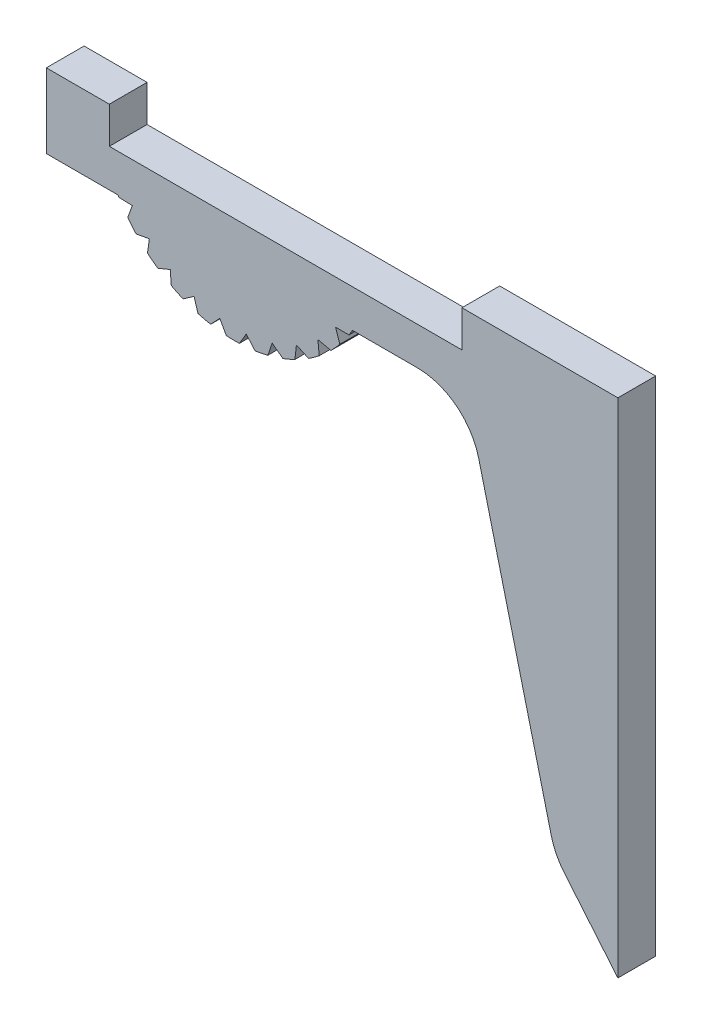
ISO-10303-21;
HEADER;
FILE_DESCRIPTION(('STEP AP214'),'2;1');
FILE_NAME('part.step','',(''),(''),'','','');
FILE_SCHEMA(('AUTOMOTIVE_DESIGN { 1 0 10303 214 1 1 1 1 }'));
ENDSEC;
DATA;
#1=APPLICATION_CONTEXT('core data for automotive mechanical design processes');
#2=APPLICATION_PROTOCOL_DEFINITION('international standard','automotive_design',2000,#1);
#3=PRODUCT_CONTEXT('',#1,'mechanical');
#4=PRODUCT('Part','Part','',(#3));
#5=PRODUCT_RELATED_PRODUCT_CATEGORY('part','',(#4));
#6=PRODUCT_DEFINITION_FORMATION('','',#4);
#7=PRODUCT_DEFINITION_CONTEXT('part definition',#1,'design');
#8=PRODUCT_DEFINITION('design','',#6,#7);
#9=PRODUCT_DEFINITION_SHAPE('','',#8);
#10=(LENGTH_UNIT() NAMED_UNIT(*) SI_UNIT(.MILLI.,.METRE.));
#11=(NAMED_UNIT(*) PLANE_ANGLE_UNIT() SI_UNIT($,.RADIAN.));
#12=(NAMED_UNIT(*) SI_UNIT($,.STERADIAN.) SOLID_ANGLE_UNIT());
#13=UNCERTAINTY_MEASURE_WITH_UNIT(LENGTH_MEASURE(1.E-05),#10,'distance_accuracy_value','');
#14=(GEOMETRIC_REPRESENTATION_CONTEXT(3) GLOBAL_UNCERTAINTY_ASSIGNED_CONTEXT((#13)) GLOBAL_UNIT_ASSIGNED_CONTEXT((#10,
#11,#12)) REPRESENTATION_CONTEXT('',''));
#15=CARTESIAN_POINT('',(0.,0.,0.));
#16=DIRECTION('',(0.,0.,1.));
#17=DIRECTION('',(1.,0.,0.));
#18=AXIS2_PLACEMENT_3D('',#15,#16,#17);
#19=CARTESIAN_POINT('',(-45.3846510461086,-6.,-3.));
#20=DIRECTION('',(0.,-1.,0.));
#21=DIRECTION('',(1.,0.,0.));
#22=AXIS2_PLACEMENT_3D('',#19,#20,#21);
#23=PLANE('',#22);
#24=DIRECTION('',(0.,0.,-1.));
#25=VECTOR('',#24,1.);
#26=CARTESIAN_POINT('',(-21.0742068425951,-6.,0.));
#27=LINE('',#26,#25);
#28=CARTESIAN_POINT('',(-21.0742068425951,-6.,0.));
#29=VERTEX_POINT('',#28);
#30=CARTESIAN_POINT('',(-21.0742068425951,-6.,-3.));
#31=VERTEX_POINT('',#30);
#32=EDGE_CURVE('E566',#29,#31,#27,.T.);
#33=ORIENTED_EDGE('',*,*,#32,.T.);
#34=DIRECTION('',(1.,0.,0.));
#35=VECTOR('',#34,1.);
#36=CARTESIAN_POINT('',(-45.3846510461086,-6.,-3.));
#37=LINE('',#36,#35);
#38=CARTESIAN_POINT('',(-15.9038820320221,-6.,-3.));
#39=VERTEX_POINT('',#38);
#40=EDGE_CURVE('E617',#31,#39,#37,.T.);
#41=ORIENTED_EDGE('',*,*,#40,.T.);
#42=DIRECTION('',(0.,0.,1.));
#43=VECTOR('',#42,1.);
#44=CARTESIAN_POINT('',(-15.9038820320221,-6.,0.));
#45=LINE('',#44,#43);
#46=CARTESIAN_POINT('',(-15.9038820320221,-6.,0.));
#47=VERTEX_POINT('',#46);
#48=EDGE_CURVE('E644',#39,#47,#45,.T.);
#49=ORIENTED_EDGE('',*,*,#48,.T.);
#50=DIRECTION('',(1.,0.,0.));
#51=VECTOR('',#50,1.);
#52=CARTESIAN_POINT('',(-45.3846510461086,-6.,0.));
#53=LINE('',#52,#51);
#54=EDGE_CURVE('E631',#29,#47,#53,.T.);
#55=ORIENTED_EDGE('',*,*,#54,.F.);
#56=EDGE_LOOP('',(#33,#41,#49,#55));
#57=FACE_BOUND('',#56,.T.);
#58=ADVANCED_FACE('F33',(#57),#23,.T.);
#59=CARTESIAN_POINT('',(-5.,-34.,-3.));
#60=DIRECTION('',(-0.768221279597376,-0.64018439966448,0.));
#61=DIRECTION('',(0.64018439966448,-0.768221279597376,0.));
#62=AXIS2_PLACEMENT_3D('',#59,#60,#61);
#63=PLANE('',#62);
#64=DIRECTION('',(0.64018439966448,-0.768221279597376,0.));
#65=VECTOR('',#64,1.);
#66=CARTESIAN_POINT('',(-5.,-34.,0.));
#67=LINE('',#66,#65);
#68=CARTESIAN_POINT('',(-4.26779266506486,-34.8786488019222,0.));
#69=VERTEX_POINT('',#68);
#70=CARTESIAN_POINT('',(0.,-40.,0.));
#71=VERTEX_POINT('',#70);
#72=EDGE_CURVE('E606',#69,#71,#67,.T.);
#73=ORIENTED_EDGE('',*,*,#72,.F.);
#74=DIRECTION('',(0.,0.,1.));
#75=VECTOR('',#74,1.);
#76=CARTESIAN_POINT('',(-4.26779266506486,-34.8786488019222,-3.));
#77=LINE('',#76,#75);
#78=CARTESIAN_POINT('',(-4.26779266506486,-34.8786488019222,-3.));
#79=VERTEX_POINT('',#78);
#80=EDGE_CURVE('E41',#69,#79,#77,.F.);
#81=ORIENTED_EDGE('',*,*,#80,.T.);
#82=DIRECTION('',(0.64018439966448,-0.768221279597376,0.));
#83=VECTOR('',#82,1.);
#84=CARTESIAN_POINT('',(-5.,-34.,-3.));
#85=LINE('',#84,#83);
#86=CARTESIAN_POINT('',(0.,-40.,-3.));
#87=VERTEX_POINT('',#86);
#88=EDGE_CURVE('E609',#79,#87,#85,.T.);
#89=ORIENTED_EDGE('',*,*,#88,.T.);
#90=DIRECTION('',(0.,0.,1.));
#91=VECTOR('',#90,1.);
#92=CARTESIAN_POINT('',(0.,-40.,-3.));
#93=LINE('',#92,#91);
#94=EDGE_CURVE('E624',#87,#71,#93,.T.);
#95=ORIENTED_EDGE('',*,*,#94,.T.);
#96=EDGE_LOOP('',(#73,#81,#89,#95));
#97=FACE_BOUND('',#96,.T.);
#98=ADVANCED_FACE('F661',(#97),#63,.T.);
#99=CARTESIAN_POINT('',(-12.,-6.,-3.));
#100=DIRECTION('',(-0.970142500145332,-0.242535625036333,0.));
#101=DIRECTION('',(0.242535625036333,-0.970142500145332,0.));
#102=AXIS2_PLACEMENT_3D('',#99,#100,#101);
#103=PLANE('',#102);
#104=DIRECTION('',(0.242535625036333,-0.970142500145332,0.));
#105=VECTOR('',#104,1.);
#106=CARTESIAN_POINT('',(-12.,-6.,-3.));
#107=LINE('',#106,#105);
#108=CARTESIAN_POINT('',(-11.0531695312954,-9.78732187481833,-3.));
#109=VERTEX_POINT('',#108);
#110=CARTESIAN_POINT('',(-5.27739876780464,-32.8904049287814,-3.));
#111=VERTEX_POINT('',#110);
#112=EDGE_CURVE('E621',#109,#111,#107,.T.);
#113=ORIENTED_EDGE('',*,*,#112,.T.);
#114=DIRECTION('',(0.,0.,1.));
#115=VECTOR('',#114,1.);
#116=CARTESIAN_POINT('',(-5.27739876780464,-32.8904049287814,-3.));
#117=LINE('',#116,#115);
#118=CARTESIAN_POINT('',(-5.27739876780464,-32.8904049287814,0.));
#119=VERTEX_POINT('',#118);
#120=EDGE_CURVE('E654',#111,#119,#117,.T.);
#121=ORIENTED_EDGE('',*,*,#120,.T.);
#122=DIRECTION('',(0.242535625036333,-0.970142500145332,0.));
#123=VECTOR('',#122,1.);
#124=CARTESIAN_POINT('',(-12.,-6.,0.));
#125=LINE('',#124,#123);
#126=CARTESIAN_POINT('',(-11.0531695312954,-9.78732187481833,0.));
#127=VERTEX_POINT('',#126);
#128=EDGE_CURVE('E612',#127,#119,#125,.T.);
#129=ORIENTED_EDGE('',*,*,#128,.F.);
#130=DIRECTION('',(0.,0.,1.));
#131=VECTOR('',#130,1.);
#132=CARTESIAN_POINT('',(-11.0531695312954,-9.78732187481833,-3.));
#133=LINE('',#132,#131);
#134=EDGE_CURVE('E647',#127,#109,#133,.F.);
#135=ORIENTED_EDGE('',*,*,#134,.T.);
#136=EDGE_LOOP('',(#113,#121,#129,#135));
#137=FACE_BOUND('',#136,.T.);
#138=ADVANCED_FACE('F671',(#137),#103,.T.);
#139=DIRECTION('',(0.,0.,-1.));
#140=VECTOR('',#139,1.);
#141=CARTESIAN_POINT('',(-39.6950952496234,-6.,0.));
#142=LINE('',#141,#140);
#143=CARTESIAN_POINT('',(-39.6950952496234,-6.,0.));
#144=VERTEX_POINT('',#143);
#145=CARTESIAN_POINT('',(-39.6950952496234,-6.,-3.));
#146=VERTEX_POINT('',#145);
#147=EDGE_CURVE('E569',#144,#146,#142,.T.);
#148=ORIENTED_EDGE('',*,*,#147,.F.);
#149=CARTESIAN_POINT('',(-45.3846510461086,-6.,0.));
#150=VERTEX_POINT('',#149);
#151=EDGE_CURVE('E632',#150,#144,#53,.T.);
#152=ORIENTED_EDGE('',*,*,#151,.F.);
#153=DIRECTION('',(0.,0.,1.));
#154=VECTOR('',#153,1.);
#155=CARTESIAN_POINT('',(-45.3846510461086,-6.,-3.));
#156=LINE('',#155,#154);
#157=CARTESIAN_POINT('',(-45.3846510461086,-6.,-3.));
#158=VERTEX_POINT('',#157);
#159=EDGE_CURVE('E636',#158,#150,#156,.T.);
#160=ORIENTED_EDGE('',*,*,#159,.F.);
#161=EDGE_CURVE('E618',#158,#146,#37,.T.);
#162=ORIENTED_EDGE('',*,*,#161,.T.);
#163=EDGE_LOOP('',(#148,#152,#160,#162));
#164=FACE_BOUND('',#163,.T.);
#165=ADVANCED_FACE('F794',(#164),#23,.T.);
#166=CARTESIAN_POINT('',(-45.3846510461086,0.,-3.));
#167=DIRECTION('',(-1.,0.,0.));
#168=DIRECTION('',(0.,0.,1.));
#169=AXIS2_PLACEMENT_3D('',#166,#167,#168);
#170=PLANE('',#169);
#171=DIRECTION('',(0.,0.,1.));
#172=VECTOR('',#171,1.);
#173=CARTESIAN_POINT('',(-45.3846510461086,-0.0999999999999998,-10.));
#174=LINE('',#173,#172);
#175=CARTESIAN_POINT('',(-45.3846510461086,-0.0999999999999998,-3.));
#176=VERTEX_POINT('',#175);
#177=CARTESIAN_POINT('',(-45.3846510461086,-0.0999999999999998,0.));
#178=VERTEX_POINT('',#177);
#179=EDGE_CURVE('E576',#176,#178,#174,.T.);
#180=ORIENTED_EDGE('',*,*,#179,.F.);
#181=DIRECTION('',(0.,-1.,0.));
#182=VECTOR('',#181,1.);
#183=CARTESIAN_POINT('',(-45.3846510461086,0.,-3.));
#184=LINE('',#183,#182);
#185=EDGE_CURVE('E615',#176,#158,#184,.T.);
#186=ORIENTED_EDGE('',*,*,#185,.T.);
#187=ORIENTED_EDGE('',*,*,#159,.T.);
#188=DIRECTION('',(0.,-1.,0.));
#189=VECTOR('',#188,1.);
#190=CARTESIAN_POINT('',(-45.3846510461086,0.,0.));
#191=LINE('',#190,#189);
#192=EDGE_CURVE('E629',#178,#150,#191,.T.);
#193=ORIENTED_EDGE('',*,*,#192,.F.);
#194=EDGE_LOOP('',(#180,#186,#187,#193));
#195=FACE_BOUND('',#194,.T.);
#196=ADVANCED_FACE('F800',(#195),#170,.T.);
#197=CARTESIAN_POINT('',(0.,-40.,-3.));
#198=DIRECTION('',(1.,0.,0.));
#199=DIRECTION('',(0.,0.,-1.));
#200=AXIS2_PLACEMENT_3D('',#197,#198,#199);
#201=PLANE('',#200);
#202=DIRECTION('',(0.,0.,1.));
#203=VECTOR('',#202,1.);
#204=CARTESIAN_POINT('',(0.,-0.1,-10.));
#205=LINE('',#204,#203);
#206=CARTESIAN_POINT('',(0.,-0.1,-3.));
#207=VERTEX_POINT('',#206);
#208=CARTESIAN_POINT('',(0.,-0.1,0.));
#209=VERTEX_POINT('',#208);
#210=EDGE_CURVE('E577',#207,#209,#205,.T.);
#211=ORIENTED_EDGE('',*,*,#210,.T.);
#212=DIRECTION('',(0.,1.,0.));
#213=VECTOR('',#212,1.);
#214=CARTESIAN_POINT('',(0.,-40.,0.));
#215=LINE('',#214,#213);
#216=EDGE_CURVE('E626',#71,#209,#215,.T.);
#217=ORIENTED_EDGE('',*,*,#216,.F.);
#218=ORIENTED_EDGE('',*,*,#94,.F.);
#219=DIRECTION('',(0.,1.,0.));
#220=VECTOR('',#219,1.);
#221=CARTESIAN_POINT('',(0.,-40.,-3.));
#222=LINE('',#221,#220);
#223=EDGE_CURVE('E611',#87,#207,#222,.T.);
#224=ORIENTED_EDGE('',*,*,#223,.T.);
#225=EDGE_LOOP('',(#211,#217,#218,#224));
#226=FACE_BOUND('',#225,.T.);
#227=ADVANCED_FACE('F822',(#226),#201,.T.);
#228=CARTESIAN_POINT('',(0.,0.,-3.));
#229=DIRECTION('',(0.,0.,-1.));
#230=DIRECTION('',(-1.,0.,0.));
#231=AXIS2_PLACEMENT_3D('',#228,#229,#230);
#232=PLANE('',#231);
#233=ORIENTED_EDGE('',*,*,#88,.F.);
#234=CARTESIAN_POINT('',(-0.426686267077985,-31.6777268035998,-3.));
#235=DIRECTION('',(0.,0.,-1.));
#236=DIRECTION('',(-1.,0.,0.));
#237=AXIS2_PLACEMENT_3D('',#234,#235,#236);
#238=CIRCLE('',#237,5.);
#239=EDGE_CURVE('E11',#79,#111,#238,.T.);
#240=ORIENTED_EDGE('',*,*,#239,.T.);
#241=ORIENTED_EDGE('',*,*,#112,.F.);
#242=CARTESIAN_POINT('',(-15.9038820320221,-11.,-3.));
#243=DIRECTION('',(0.,0.,-1.));
#244=DIRECTION('',(-1.,0.,0.));
#245=AXIS2_PLACEMENT_3D('',#242,#243,#244);
#246=CIRCLE('',#245,5.);
#247=EDGE_CURVE('E651',#109,#39,#246,.F.);
#248=ORIENTED_EDGE('',*,*,#247,.T.);
#249=ORIENTED_EDGE('',*,*,#40,.F.);
#250=CARTESIAN_POINT('',(-30.3846510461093,-0.656989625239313,-3.));
#251=DIRECTION('',(0.,0.,-1.));
#252=DIRECTION('',(-1.,0.,0.));
#253=AXIS2_PLACEMENT_3D('',#250,#251,#252);
#254=CIRCLE('',#253,10.7346230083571);
#255=CARTESIAN_POINT('',(-21.3495530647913,-6.45346576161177,-3.));
#256=VERTEX_POINT('',#255);
#257=EDGE_CURVE('E435',#31,#256,#254,.T.);
#258=ORIENTED_EDGE('',*,*,#257,.T.);
#259=DIRECTION('',(-1.,0.,0.));
#260=VECTOR('',#259,1.);
#261=CARTESIAN_POINT('',(-21.3495530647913,-6.45346576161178,-3.));
#262=LINE('',#261,#260);
#263=CARTESIAN_POINT('',(-22.4135685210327,-6.45346576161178,-3.));
#264=VERTEX_POINT('',#263);
#265=EDGE_CURVE('E438',#256,#264,#262,.T.);
#266=ORIENTED_EDGE('',*,*,#265,.T.);
#267=DIRECTION('',(0.308213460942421,-0.95131722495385,0.));
#268=VECTOR('',#267,1.);
#269=CARTESIAN_POINT('',(-22.4135685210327,-6.45346576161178,-3.));
#270=LINE('',#269,#268);
#271=CARTESIAN_POINT('',(-22.0856246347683,-7.46568199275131,-3.));
#272=VERTEX_POINT('',#271);
#273=EDGE_CURVE('E441',#264,#272,#270,.T.);
#274=ORIENTED_EDGE('',*,*,#273,.T.);
#275=CARTESIAN_POINT('',(-30.3846510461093,-0.656989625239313,-3.));
#276=DIRECTION('',(0.,0.,-1.));
#277=DIRECTION('',(-1.,0.,0.));
#278=AXIS2_PLACEMENT_3D('',#275,#276,#277);
#279=CIRCLE('',#278,10.7346230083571);
#280=CARTESIAN_POINT('',(-22.7814803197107,-8.23484724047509,-3.));
#281=VERTEX_POINT('',#280);
#282=EDGE_CURVE('E444',#272,#281,#279,.T.);
#283=ORIENTED_EDGE('',*,*,#282,.T.);
#284=DIRECTION('',(-0.977333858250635,0.211703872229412,0.));
#285=VECTOR('',#284,1.);
#286=CARTESIAN_POINT('',(-22.7814803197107,-8.23484724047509,-3.));
#287=LINE('',#286,#285);
#288=CARTESIAN_POINT('',(-23.8213786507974,-8.00959104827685,-3.));
#289=VERTEX_POINT('',#288);
#290=EDGE_CURVE('E447',#281,#289,#287,.T.);
#291=ORIENTED_EDGE('',*,*,#290,.T.);
#292=DIRECTION('',(0.0998299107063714,-0.995004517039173,0.));
#293=VECTOR('',#292,1.);
#294=CARTESIAN_POINT('',(-23.8213786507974,-8.00959104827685,-3.));
#295=LINE('',#294,#293);
#296=CARTESIAN_POINT('',(-23.7151580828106,-9.06829123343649,-3.));
#297=VERTEX_POINT('',#296);
#298=EDGE_CURVE('E450',#289,#297,#295,.T.);
#299=ORIENTED_EDGE('',*,*,#298,.T.);
#300=CARTESIAN_POINT('',(-30.3846510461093,-0.656989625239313,-3.));
#301=DIRECTION('',(0.,0.,-1.));
#302=DIRECTION('',(-1.,0.,0.));
#303=AXIS2_PLACEMENT_3D('',#300,#301,#302);
#304=CIRCLE('',#303,10.7346230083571);
#305=CARTESIAN_POINT('',(-24.5580766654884,-9.67270712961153,-3.));
#306=VERTEX_POINT('',#305);
#307=EDGE_CURVE('E453',#297,#306,#304,.T.);
#308=ORIENTED_EDGE('',*,*,#307,.T.);
#309=DIRECTION('',(-0.910362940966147,0.413810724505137,0.));
#310=VECTOR('',#309,1.);
#311=CARTESIAN_POINT('',(-24.5580766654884,-9.67270712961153,-3.));
#312=LINE('',#311,#310);
#313=CARTESIAN_POINT('',(-25.5267169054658,-9.23240612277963,-3.));
#314=VERTEX_POINT('',#313);
#315=EDGE_CURVE('E456',#306,#314,#312,.T.);
#316=ORIENTED_EDGE('',*,*,#315,.T.);
#317=DIRECTION('',(-0.113079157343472,-0.99358598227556,0.));
#318=VECTOR('',#317,1.);
#319=CARTESIAN_POINT('',(-25.5267169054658,-9.23240612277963,-3.));
#320=LINE('',#319,#318);
#321=CARTESIAN_POINT('',(-25.647034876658,-10.2895969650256,-3.));
#322=VERTEX_POINT('',#321);
#323=EDGE_CURVE('E459',#314,#322,#320,.T.);
#324=ORIENTED_EDGE('',*,*,#323,.T.);
#325=CARTESIAN_POINT('',(-30.3846510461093,-0.656989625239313,-3.));
#326=DIRECTION('',(0.,0.,-1.));
#327=DIRECTION('',(-1.,0.,0.));
#328=AXIS2_PLACEMENT_3D('',#325,#326,#327);
#329=CIRCLE('',#328,10.7346230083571);
#330=CARTESIAN_POINT('',(-26.5988049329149,-10.7018639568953,-3.));
#331=VERTEX_POINT('',#330);
#332=EDGE_CURVE('E462',#322,#331,#329,.T.);
#333=ORIENTED_EDGE('',*,*,#332,.T.);
#334=DIRECTION('',(-0.802123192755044,0.597158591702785,0.));
#335=VECTOR('',#334,1.);
#336=CARTESIAN_POINT('',(-26.5988049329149,-10.7018639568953,-3.));
#337=LINE('',#336,#335);
#338=CARTESIAN_POINT('',(-27.4522764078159,-10.0664779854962,-3.));
#339=VERTEX_POINT('',#338);
#340=EDGE_CURVE('E465',#331,#339,#337,.T.);
#341=ORIENTED_EDGE('',*,*,#340,.T.);
#342=DIRECTION('',(-0.320862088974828,-0.947125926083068,0.));
#343=VECTOR('',#342,1.);
#344=CARTESIAN_POINT('',(-27.4522764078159,-10.0664779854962,-3.));
#345=LINE('',#344,#343);
#346=CARTESIAN_POINT('',(-27.793678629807,-11.0742346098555,-3.));
#347=VERTEX_POINT('',#346);
#348=EDGE_CURVE('E468',#339,#347,#345,.T.);
#349=ORIENTED_EDGE('',*,*,#348,.T.);
#350=CARTESIAN_POINT('',(-30.3846510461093,-0.656989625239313,-3.));
#351=DIRECTION('',(0.,0.,-1.));
#352=DIRECTION('',(-1.,0.,0.));
#353=AXIS2_PLACEMENT_3D('',#350,#351,#352);
#354=CIRCLE('',#353,10.7346230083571);
#355=CARTESIAN_POINT('',(-28.8111542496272,-11.2756636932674,-3.));
#356=VERTEX_POINT('',#355);
#357=EDGE_CURVE('E471',#347,#356,#354,.T.);
#358=ORIENTED_EDGE('',*,*,#357,.T.);
#359=DIRECTION('',(-0.657521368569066,0.753435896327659,0.));
#360=VECTOR('',#359,1.);
#361=CARTESIAN_POINT('',(-28.8111542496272,-11.2756636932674,-3.));
#362=LINE('',#361,#360);
#363=CARTESIAN_POINT('',(-29.5107671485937,-10.4739962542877,-3.));
#364=VERTEX_POINT('',#363);
#365=EDGE_CURVE('E474',#356,#364,#362,.T.);
#366=ORIENTED_EDGE('',*,*,#365,.T.);
#367=DIRECTION('',(-0.51409960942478,-0.857730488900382,0.));
#368=VECTOR('',#367,1.);
#369=CARTESIAN_POINT('',(-29.5107671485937,-10.4739962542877,-3.));
#370=LINE('',#369,#368);
#371=CARTESIAN_POINT('',(-30.0577770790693,-11.3866347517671,-3.));
#372=VERTEX_POINT('',#371);
#373=EDGE_CURVE('E477',#364,#372,#370,.T.);
#374=ORIENTED_EDGE('',*,*,#373,.T.);
#375=CARTESIAN_POINT('',(-30.3846510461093,-0.656989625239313,-3.));
#376=DIRECTION('',(0.,0.,-1.));
#377=DIRECTION('',(-1.,0.,0.));
#378=AXIS2_PLACEMENT_3D('',#375,#376,#377);
#379=CIRCLE('',#378,10.7346230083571);
#380=CARTESIAN_POINT('',(-31.094833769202,-11.368094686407,-3.));
#381=VERTEX_POINT('',#380);
#382=EDGE_CURVE('E480',#372,#381,#379,.T.);
#383=ORIENTED_EDGE('',*,*,#382,.T.);
#384=DIRECTION('',(-0.483112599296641,0.87555823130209,0.));
#385=VECTOR('',#384,1.);
#386=CARTESIAN_POINT('',(-31.094833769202,-11.368094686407,-3.));
#387=LINE('',#386,#385);
#388=CARTESIAN_POINT('',(-31.6088730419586,-10.4364871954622,-3.));
#389=VERTEX_POINT('',#388);
#390=EDGE_CURVE('E483',#381,#389,#387,.T.);
#391=ORIENTED_EDGE('',*,*,#390,.T.);
#392=DIRECTION('',(-0.684031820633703,-0.729452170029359,0.));
#393=VECTOR('',#392,1.);
#394=CARTESIAN_POINT('',(-31.6088730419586,-10.4364871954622,-3.));
#395=LINE('',#394,#393);
#396=CARTESIAN_POINT('',(-32.3366934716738,-11.2126355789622,-3.));
#397=VERTEX_POINT('',#396);
#398=EDGE_CURVE('E486',#389,#397,#395,.T.);
#399=ORIENTED_EDGE('',*,*,#398,.T.);
#400=CARTESIAN_POINT('',(-30.3846510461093,-0.656989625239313,-3.));
#401=DIRECTION('',(0.,0.,-1.));
#402=DIRECTION('',(-1.,0.,0.));
#403=AXIS2_PLACEMENT_3D('',#400,#401,#402);
#404=CIRCLE('',#403,10.7346230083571);
#405=CARTESIAN_POINT('',(-33.3463190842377,-10.974966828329,-3.));
#406=VERTEX_POINT('',#405);
#407=EDGE_CURVE('E489',#397,#406,#404,.T.);
#408=ORIENTED_EDGE('',*,*,#407,.T.);
#409=DIRECTION('',(-0.286803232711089,0.957989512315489,0.));
#410=VECTOR('',#409,1.);
#411=CARTESIAN_POINT('',(-33.3463190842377,-10.974966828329,-3.));
#412=LINE('',#411,#410);
#413=CARTESIAN_POINT('',(-33.6514821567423,-9.95565118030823,-3.));
#414=VERTEX_POINT('',#413);
#415=EDGE_CURVE('E492',#406,#414,#412,.T.);
#416=ORIENTED_EDGE('',*,*,#415,.T.);
#417=DIRECTION('',(-0.822955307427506,-0.568106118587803,0.));
#418=VECTOR('',#417,1.);
#419=CARTESIAN_POINT('',(-33.6514821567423,-9.95565118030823,-3.));
#420=LINE('',#419,#418);
#421=CARTESIAN_POINT('',(-34.527119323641,-10.5601248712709,-3.));
#422=VERTEX_POINT('',#421);
#423=EDGE_CURVE('E495',#414,#422,#420,.T.);
#424=ORIENTED_EDGE('',*,*,#423,.T.);
#425=CARTESIAN_POINT('',(-30.3846510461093,-0.656989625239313,-3.));
#426=DIRECTION('',(0.,0.,-1.));
#427=DIRECTION('',(-1.,0.,0.));
#428=AXIS2_PLACEMENT_3D('',#425,#426,#427);
#429=CIRCLE('',#428,10.7346230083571);
#430=CARTESIAN_POINT('',(-35.4635452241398,-10.1141015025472,-3.));
#431=VERTEX_POINT('',#430);
#432=EDGE_CURVE('E498',#422,#431,#429,.T.);
#433=ORIENTED_EDGE('',*,*,#432,.T.);
#434=DIRECTION('',(-0.0774924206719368,0.996992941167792,0.));
#435=VECTOR('',#434,1.);
#436=CARTESIAN_POINT('',(-35.4635452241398,-10.1141015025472,-3.));
#437=LINE('',#436,#435);
#438=CARTESIAN_POINT('',(-35.5459983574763,-9.05328560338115,-3.));
#439=VERTEX_POINT('',#438);
#440=EDGE_CURVE('E501',#431,#439,#437,.T.);
#441=ORIENTED_EDGE('',*,*,#440,.T.);
#442=DIRECTION('',(-0.924572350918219,-0.381006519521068,0.));
#443=VECTOR('',#442,1.);
#444=CARTESIAN_POINT('',(-35.5459983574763,-9.05328560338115,-3.));
#445=LINE('',#444,#443);
#446=CARTESIAN_POINT('',(-36.5297576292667,-9.45868242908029,-3.));
#447=VERTEX_POINT('',#446);
#448=EDGE_CURVE('E504',#439,#447,#445,.T.);
#449=ORIENTED_EDGE('',*,*,#448,.T.);
#450=CARTESIAN_POINT('',(-30.3846510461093,-0.656989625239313,-3.));
#451=DIRECTION('',(0.,0.,-1.));
#452=DIRECTION('',(-1.,0.,0.));
#453=AXIS2_PLACEMENT_3D('',#450,#451,#452);
#454=CIRCLE('',#453,10.7346230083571);
#455=CARTESIAN_POINT('',(-37.3505334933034,-8.82452370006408,-3.));
#456=VERTEX_POINT('',#455);
#457=EDGE_CURVE('E507',#447,#456,#454,.T.);
#458=ORIENTED_EDGE('',*,*,#457,.T.);
#459=DIRECTION('',(0.135331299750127,0.990800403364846,0.));
#460=VECTOR('',#459,1.);
#461=CARTESIAN_POINT('',(-37.3505334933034,-8.82452370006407,-3.));
#462=LINE('',#461,#460);
#463=CARTESIAN_POINT('',(-37.206538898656,-7.77029675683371,-3.));
#464=VERTEX_POINT('',#463);
#465=EDGE_CURVE('E343',#456,#464,#462,.T.);
#466=ORIENTED_EDGE('',*,*,#465,.T.);
#467=DIRECTION('',(-0.984276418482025,-0.176635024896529,0.));
#468=VECTOR('',#467,1.);
#469=CARTESIAN_POINT('',(-37.206538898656,-7.77029675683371,-3.));
#470=LINE('',#469,#468);
#471=CARTESIAN_POINT('',(-38.2538242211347,-7.95823915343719,-3.));
#472=VERTEX_POINT('',#471);
#473=EDGE_CURVE('E340',#464,#472,#470,.T.);
#474=ORIENTED_EDGE('',*,*,#473,.T.);
#475=CARTESIAN_POINT('',(-30.3846510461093,-0.656989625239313,-3.));
#476=DIRECTION('',(0.,0.,-1.));
#477=DIRECTION('',(-1.,0.,0.));
#478=AXIS2_PLACEMENT_3D('',#475,#476,#477);
#479=CIRCLE('',#478,10.7346230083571);
#480=CARTESIAN_POINT('',(-38.9217424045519,-7.16469292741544,-3.));
#481=VERTEX_POINT('',#480);
#482=EDGE_CURVE('E426',#472,#481,#479,.T.);
#483=ORIENTED_EDGE('',*,*,#482,.T.);
#484=DIRECTION('',(0.342020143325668,0.939692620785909,0.));
#485=VECTOR('',#484,1.);
#486=CARTESIAN_POINT('',(-38.9217424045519,-7.16469292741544,-3.));
#487=LINE('',#486,#485);
#488=CARTESIAN_POINT('',(-38.5578276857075,-6.16484545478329,-3.));
#489=VERTEX_POINT('',#488);
#490=EDGE_CURVE('E319',#481,#489,#487,.T.);
#491=ORIENTED_EDGE('',*,*,#490,.T.);
#492=DIRECTION('',(-0.999360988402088,0.0357437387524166,0.));
#493=VECTOR('',#492,1.);
#494=CARTESIAN_POINT('',(-38.5578276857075,-6.16484545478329,-3.));
#495=LINE('',#494,#493);
#496=CARTESIAN_POINT('',(-39.621163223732,-6.12681356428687,-3.));
#497=VERTEX_POINT('',#496);
#498=EDGE_CURVE('E429',#489,#497,#495,.T.);
#499=ORIENTED_EDGE('',*,*,#498,.T.);
#500=CARTESIAN_POINT('',(-30.3846510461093,-0.656989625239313,-3.));
#501=DIRECTION('',(0.,0.,-1.));
#502=DIRECTION('',(-1.,0.,0.));
#503=AXIS2_PLACEMENT_3D('',#500,#501,#502);
#504=CIRCLE('',#503,10.7346230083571);
#505=EDGE_CURVE('E432',#497,#146,#504,.T.);
#506=ORIENTED_EDGE('',*,*,#505,.T.);
#507=ORIENTED_EDGE('',*,*,#161,.F.);
#508=ORIENTED_EDGE('',*,*,#185,.F.);
#509=DIRECTION('',(-1.,0.,0.));
#510=VECTOR('',#509,1.);
#511=CARTESIAN_POINT('',(0.,-0.1,-3.));
#512=LINE('',#511,#510);
#513=CARTESIAN_POINT('',(-40.3846510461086,-0.0999999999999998,-3.));
#514=VERTEX_POINT('',#513);
#515=EDGE_CURVE('E580',#514,#176,#512,.T.);
#516=ORIENTED_EDGE('',*,*,#515,.F.);
#517=DIRECTION('',(0.,1.,0.));
#518=VECTOR('',#517,1.);
#519=CARTESIAN_POINT('',(-40.3846510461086,0.,-3.));
#520=LINE('',#519,#518);
#521=CARTESIAN_POINT('',(-40.3846510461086,-3.,-3.));
#522=VERTEX_POINT('',#521);
#523=EDGE_CURVE('E590',#522,#514,#520,.T.);
#524=ORIENTED_EDGE('',*,*,#523,.F.);
#525=DIRECTION('',(-1.,0.,0.));
#526=VECTOR('',#525,1.);
#527=CARTESIAN_POINT('',(-12.3846510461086,-3.,-3.));
#528=LINE('',#527,#526);
#529=CARTESIAN_POINT('',(-12.3846510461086,-3.,-3.));
#530=VERTEX_POINT('',#529);
#531=EDGE_CURVE('E599',#530,#522,#528,.T.);
#532=ORIENTED_EDGE('',*,*,#531,.F.);
#533=DIRECTION('',(0.,-1.,0.));
#534=VECTOR('',#533,1.);
#535=CARTESIAN_POINT('',(-12.3846510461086,0.,-3.));
#536=LINE('',#535,#534);
#537=CARTESIAN_POINT('',(-12.3846510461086,-0.1,-3.));
#538=VERTEX_POINT('',#537);
#539=EDGE_CURVE('E597',#538,#530,#536,.T.);
#540=ORIENTED_EDGE('',*,*,#539,.F.);
#541=EDGE_CURVE('E584',#207,#538,#512,.T.);
#542=ORIENTED_EDGE('',*,*,#541,.F.);
#543=ORIENTED_EDGE('',*,*,#223,.F.);
#544=EDGE_LOOP('',(#233,#240,#241,#248,#249,#258,#266,#274,#283,#291,#299,#308,#316,#324,#333,
#341,#349,#358,#366,#374,#383,#391,#399,#408,#416,#424,#433,#441,#449,#458,#466,#474,#483,#491,
#499,#506,#507,#508,#516,#524,#532,#540,#542,#543));
#545=FACE_BOUND('',#544,.T.);
#546=ADVANCED_FACE('F667',(#545),#232,.T.);
#547=CARTESIAN_POINT('',(0.,0.,0.));
#548=DIRECTION('',(0.,0.,-1.));
#549=DIRECTION('',(-1.,0.,0.));
#550=AXIS2_PLACEMENT_3D('',#547,#548,#549);
#551=PLANE('',#550);
#552=ORIENTED_EDGE('',*,*,#128,.T.);
#553=CARTESIAN_POINT('',(-0.426686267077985,-31.6777268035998,0.));
#554=DIRECTION('',(0.,0.,-1.));
#555=DIRECTION('',(-1.,0.,0.));
#556=AXIS2_PLACEMENT_3D('',#553,#554,#555);
#557=CIRCLE('',#556,5.);
#558=EDGE_CURVE('E657',#119,#69,#557,.F.);
#559=ORIENTED_EDGE('',*,*,#558,.T.);
#560=ORIENTED_EDGE('',*,*,#72,.T.);
#561=ORIENTED_EDGE('',*,*,#216,.T.);
#562=DIRECTION('',(1.,0.,0.));
#563=VECTOR('',#562,1.);
#564=CARTESIAN_POINT('',(-45.3846510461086,-0.0999999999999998,0.));
#565=LINE('',#564,#563);
#566=CARTESIAN_POINT('',(-12.3846510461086,-0.1,0.));
#567=VERTEX_POINT('',#566);
#568=EDGE_CURVE('E513',#567,#209,#565,.T.);
#569=ORIENTED_EDGE('',*,*,#568,.F.);
#570=DIRECTION('',(0.,-1.,0.));
#571=VECTOR('',#570,1.);
#572=CARTESIAN_POINT('',(-12.3846510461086,0.,0.));
#573=LINE('',#572,#571);
#574=CARTESIAN_POINT('',(-12.3846510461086,-3.,0.));
#575=VERTEX_POINT('',#574);
#576=EDGE_CURVE('E587',#567,#575,#573,.T.);
#577=ORIENTED_EDGE('',*,*,#576,.T.);
#578=DIRECTION('',(-1.,0.,0.));
#579=VECTOR('',#578,1.);
#580=CARTESIAN_POINT('',(-12.3846510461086,-3.,0.));
#581=LINE('',#580,#579);
#582=CARTESIAN_POINT('',(-40.3846510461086,-3.,0.));
#583=VERTEX_POINT('',#582);
#584=EDGE_CURVE('E589',#575,#583,#581,.T.);
#585=ORIENTED_EDGE('',*,*,#584,.T.);
#586=DIRECTION('',(0.,1.,0.));
#587=VECTOR('',#586,1.);
#588=CARTESIAN_POINT('',(-40.3846510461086,0.,0.));
#589=LINE('',#588,#587);
#590=CARTESIAN_POINT('',(-40.3846510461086,-0.1,0.));
#591=VERTEX_POINT('',#590);
#592=EDGE_CURVE('E593',#583,#591,#589,.T.);
#593=ORIENTED_EDGE('',*,*,#592,.T.);
#594=EDGE_CURVE('E574',#178,#591,#565,.T.);
#595=ORIENTED_EDGE('',*,*,#594,.F.);
#596=ORIENTED_EDGE('',*,*,#192,.T.);
#597=ORIENTED_EDGE('',*,*,#151,.T.);
#598=CARTESIAN_POINT('',(-30.3846510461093,-0.656989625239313,0.));
#599=DIRECTION('',(0.,0.,-1.));
#600=DIRECTION('',(-1.,0.,0.));
#601=AXIS2_PLACEMENT_3D('',#598,#599,#600);
#602=CIRCLE('',#601,10.7346230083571);
#603=CARTESIAN_POINT('',(-39.621163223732,-6.12681356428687,0.));
#604=VERTEX_POINT('',#603);
#605=EDGE_CURVE('E347',#604,#144,#602,.T.);
#606=ORIENTED_EDGE('',*,*,#605,.F.);
#607=DIRECTION('',(-0.999360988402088,0.0357437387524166,0.));
#608=VECTOR('',#607,1.);
#609=CARTESIAN_POINT('',(-38.5578276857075,-6.16484545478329,0.));
#610=LINE('',#609,#608);
#611=CARTESIAN_POINT('',(-38.5578276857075,-6.16484545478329,0.));
#612=VERTEX_POINT('',#611);
#613=EDGE_CURVE('E336',#612,#604,#610,.T.);
#614=ORIENTED_EDGE('',*,*,#613,.F.);
#615=DIRECTION('',(0.342020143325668,0.939692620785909,0.));
#616=VECTOR('',#615,1.);
#617=CARTESIAN_POINT('',(-38.9217424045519,-7.16469292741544,0.));
#618=LINE('',#617,#616);
#619=CARTESIAN_POINT('',(-38.9217424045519,-7.16469292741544,0.));
#620=VERTEX_POINT('',#619);
#621=EDGE_CURVE('E317',#620,#612,#618,.T.);
#622=ORIENTED_EDGE('',*,*,#621,.F.);
#623=CARTESIAN_POINT('',(-30.3846510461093,-0.656989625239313,0.));
#624=DIRECTION('',(0.,0.,-1.));
#625=DIRECTION('',(-1.,0.,0.));
#626=AXIS2_PLACEMENT_3D('',#623,#624,#625);
#627=CIRCLE('',#626,10.7346230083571);
#628=CARTESIAN_POINT('',(-38.2538242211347,-7.95823915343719,0.));
#629=VERTEX_POINT('',#628);
#630=EDGE_CURVE('E332',#629,#620,#627,.T.);
#631=ORIENTED_EDGE('',*,*,#630,.F.);
#632=DIRECTION('',(-0.984276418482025,-0.176635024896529,0.));
#633=VECTOR('',#632,1.);
#634=CARTESIAN_POINT('',(-37.206538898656,-7.77029675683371,0.));
#635=LINE('',#634,#633);
#636=CARTESIAN_POINT('',(-37.206538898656,-7.77029675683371,0.));
#637=VERTEX_POINT('',#636);
#638=EDGE_CURVE('E325',#637,#629,#635,.T.);
#639=ORIENTED_EDGE('',*,*,#638,.F.);
#640=DIRECTION('',(0.135331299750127,0.990800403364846,0.));
#641=VECTOR('',#640,1.);
#642=CARTESIAN_POINT('',(-37.3505334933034,-8.82452370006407,0.));
#643=LINE('',#642,#641);
#644=CARTESIAN_POINT('',(-37.3505334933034,-8.82452370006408,0.));
#645=VERTEX_POINT('',#644);
#646=EDGE_CURVE('E422',#645,#637,#643,.T.);
#647=ORIENTED_EDGE('',*,*,#646,.F.);
#648=CARTESIAN_POINT('',(-30.3846510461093,-0.656989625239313,0.));
#649=DIRECTION('',(0.,0.,-1.));
#650=DIRECTION('',(-1.,0.,0.));
#651=AXIS2_PLACEMENT_3D('',#648,#649,#650);
#652=CIRCLE('',#651,10.7346230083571);
#653=CARTESIAN_POINT('',(-36.5297576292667,-9.45868242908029,0.));
#654=VERTEX_POINT('',#653);
#655=EDGE_CURVE('E419',#654,#645,#652,.T.);
#656=ORIENTED_EDGE('',*,*,#655,.F.);
#657=DIRECTION('',(-0.924572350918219,-0.381006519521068,0.));
#658=VECTOR('',#657,1.);
#659=CARTESIAN_POINT('',(-35.5459983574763,-9.05328560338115,0.));
#660=LINE('',#659,#658);
#661=CARTESIAN_POINT('',(-35.5459983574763,-9.05328560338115,0.));
#662=VERTEX_POINT('',#661);
#663=EDGE_CURVE('E416',#662,#654,#660,.T.);
#664=ORIENTED_EDGE('',*,*,#663,.F.);
#665=DIRECTION('',(-0.0774924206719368,0.996992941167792,0.));
#666=VECTOR('',#665,1.);
#667=CARTESIAN_POINT('',(-35.4635452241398,-10.1141015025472,0.));
#668=LINE('',#667,#666);
#669=CARTESIAN_POINT('',(-35.4635452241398,-10.1141015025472,0.));
#670=VERTEX_POINT('',#669);
#671=EDGE_CURVE('E413',#670,#662,#668,.T.);
#672=ORIENTED_EDGE('',*,*,#671,.F.);
#673=CARTESIAN_POINT('',(-30.3846510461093,-0.656989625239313,0.));
#674=DIRECTION('',(0.,0.,-1.));
#675=DIRECTION('',(-1.,0.,0.));
#676=AXIS2_PLACEMENT_3D('',#673,#674,#675);
#677=CIRCLE('',#676,10.7346230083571);
#678=CARTESIAN_POINT('',(-34.527119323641,-10.5601248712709,0.));
#679=VERTEX_POINT('',#678);
#680=EDGE_CURVE('E410',#679,#670,#677,.T.);
#681=ORIENTED_EDGE('',*,*,#680,.F.);
#682=DIRECTION('',(-0.822955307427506,-0.568106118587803,0.));
#683=VECTOR('',#682,1.);
#684=CARTESIAN_POINT('',(-33.6514821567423,-9.95565118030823,0.));
#685=LINE('',#684,#683);
#686=CARTESIAN_POINT('',(-33.6514821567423,-9.95565118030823,0.));
#687=VERTEX_POINT('',#686);
#688=EDGE_CURVE('E407',#687,#679,#685,.T.);
#689=ORIENTED_EDGE('',*,*,#688,.F.);
#690=DIRECTION('',(-0.286803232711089,0.957989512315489,0.));
#691=VECTOR('',#690,1.);
#692=CARTESIAN_POINT('',(-33.3463190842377,-10.974966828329,0.));
#693=LINE('',#692,#691);
#694=CARTESIAN_POINT('',(-33.3463190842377,-10.974966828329,0.));
#695=VERTEX_POINT('',#694);
#696=EDGE_CURVE('E404',#695,#687,#693,.T.);
#697=ORIENTED_EDGE('',*,*,#696,.F.);
#698=CARTESIAN_POINT('',(-30.3846510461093,-0.656989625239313,0.));
#699=DIRECTION('',(0.,0.,-1.));
#700=DIRECTION('',(-1.,0.,0.));
#701=AXIS2_PLACEMENT_3D('',#698,#699,#700);
#702=CIRCLE('',#701,10.7346230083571);
#703=CARTESIAN_POINT('',(-32.3366934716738,-11.2126355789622,0.));
#704=VERTEX_POINT('',#703);
#705=EDGE_CURVE('E401',#704,#695,#702,.T.);
#706=ORIENTED_EDGE('',*,*,#705,.F.);
#707=DIRECTION('',(-0.684031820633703,-0.729452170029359,0.));
#708=VECTOR('',#707,1.);
#709=CARTESIAN_POINT('',(-31.6088730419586,-10.4364871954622,0.));
#710=LINE('',#709,#708);
#711=CARTESIAN_POINT('',(-31.6088730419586,-10.4364871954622,0.));
#712=VERTEX_POINT('',#711);
#713=EDGE_CURVE('E398',#712,#704,#710,.T.);
#714=ORIENTED_EDGE('',*,*,#713,.F.);
#715=DIRECTION('',(-0.483112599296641,0.87555823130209,0.));
#716=VECTOR('',#715,1.);
#717=CARTESIAN_POINT('',(-31.094833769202,-11.368094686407,0.));
#718=LINE('',#717,#716);
#719=CARTESIAN_POINT('',(-31.094833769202,-11.368094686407,0.));
#720=VERTEX_POINT('',#719);
#721=EDGE_CURVE('E395',#720,#712,#718,.T.);
#722=ORIENTED_EDGE('',*,*,#721,.F.);
#723=CARTESIAN_POINT('',(-30.3846510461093,-0.656989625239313,0.));
#724=DIRECTION('',(0.,0.,-1.));
#725=DIRECTION('',(-1.,0.,0.));
#726=AXIS2_PLACEMENT_3D('',#723,#724,#725);
#727=CIRCLE('',#726,10.7346230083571);
#728=CARTESIAN_POINT('',(-30.0577770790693,-11.3866347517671,0.));
#729=VERTEX_POINT('',#728);
#730=EDGE_CURVE('E392',#729,#720,#727,.T.);
#731=ORIENTED_EDGE('',*,*,#730,.F.);
#732=DIRECTION('',(-0.51409960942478,-0.857730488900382,0.));
#733=VECTOR('',#732,1.);
#734=CARTESIAN_POINT('',(-29.5107671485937,-10.4739962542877,0.));
#735=LINE('',#734,#733);
#736=CARTESIAN_POINT('',(-29.5107671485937,-10.4739962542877,0.));
#737=VERTEX_POINT('',#736);
#738=EDGE_CURVE('E389',#737,#729,#735,.T.);
#739=ORIENTED_EDGE('',*,*,#738,.F.);
#740=DIRECTION('',(-0.657521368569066,0.753435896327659,0.));
#741=VECTOR('',#740,1.);
#742=CARTESIAN_POINT('',(-28.8111542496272,-11.2756636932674,0.));
#743=LINE('',#742,#741);
#744=CARTESIAN_POINT('',(-28.8111542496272,-11.2756636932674,0.));
#745=VERTEX_POINT('',#744);
#746=EDGE_CURVE('E386',#745,#737,#743,.T.);
#747=ORIENTED_EDGE('',*,*,#746,.F.);
#748=CARTESIAN_POINT('',(-30.3846510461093,-0.656989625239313,0.));
#749=DIRECTION('',(0.,0.,-1.));
#750=DIRECTION('',(-1.,0.,0.));
#751=AXIS2_PLACEMENT_3D('',#748,#749,#750);
#752=CIRCLE('',#751,10.7346230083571);
#753=CARTESIAN_POINT('',(-27.793678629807,-11.0742346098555,0.));
#754=VERTEX_POINT('',#753);
#755=EDGE_CURVE('E383',#754,#745,#752,.T.);
#756=ORIENTED_EDGE('',*,*,#755,.F.);
#757=DIRECTION('',(-0.320862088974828,-0.947125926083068,0.));
#758=VECTOR('',#757,1.);
#759=CARTESIAN_POINT('',(-27.4522764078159,-10.0664779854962,0.));
#760=LINE('',#759,#758);
#761=CARTESIAN_POINT('',(-27.4522764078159,-10.0664779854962,0.));
#762=VERTEX_POINT('',#761);
#763=EDGE_CURVE('E380',#762,#754,#760,.T.);
#764=ORIENTED_EDGE('',*,*,#763,.F.);
#765=DIRECTION('',(-0.802123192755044,0.597158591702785,0.));
#766=VECTOR('',#765,1.);
#767=CARTESIAN_POINT('',(-26.5988049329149,-10.7018639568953,0.));
#768=LINE('',#767,#766);
#769=CARTESIAN_POINT('',(-26.5988049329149,-10.7018639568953,0.));
#770=VERTEX_POINT('',#769);
#771=EDGE_CURVE('E377',#770,#762,#768,.T.);
#772=ORIENTED_EDGE('',*,*,#771,.F.);
#773=CARTESIAN_POINT('',(-30.3846510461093,-0.656989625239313,0.));
#774=DIRECTION('',(0.,0.,-1.));
#775=DIRECTION('',(-1.,0.,0.));
#776=AXIS2_PLACEMENT_3D('',#773,#774,#775);
#777=CIRCLE('',#776,10.7346230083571);
#778=CARTESIAN_POINT('',(-25.647034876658,-10.2895969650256,0.));
#779=VERTEX_POINT('',#778);
#780=EDGE_CURVE('E374',#779,#770,#777,.T.);
#781=ORIENTED_EDGE('',*,*,#780,.F.);
#782=DIRECTION('',(-0.113079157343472,-0.99358598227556,0.));
#783=VECTOR('',#782,1.);
#784=CARTESIAN_POINT('',(-25.5267169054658,-9.23240612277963,0.));
#785=LINE('',#784,#783);
#786=CARTESIAN_POINT('',(-25.5267169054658,-9.23240612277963,0.));
#787=VERTEX_POINT('',#786);
#788=EDGE_CURVE('E371',#787,#779,#785,.T.);
#789=ORIENTED_EDGE('',*,*,#788,.F.);
#790=DIRECTION('',(-0.910362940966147,0.413810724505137,0.));
#791=VECTOR('',#790,1.);
#792=CARTESIAN_POINT('',(-24.5580766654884,-9.67270712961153,0.));
#793=LINE('',#792,#791);
#794=CARTESIAN_POINT('',(-24.5580766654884,-9.67270712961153,0.));
#795=VERTEX_POINT('',#794);
#796=EDGE_CURVE('E368',#795,#787,#793,.T.);
#797=ORIENTED_EDGE('',*,*,#796,.F.);
#798=CARTESIAN_POINT('',(-30.3846510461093,-0.656989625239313,0.));
#799=DIRECTION('',(0.,0.,-1.));
#800=DIRECTION('',(-1.,0.,0.));
#801=AXIS2_PLACEMENT_3D('',#798,#799,#800);
#802=CIRCLE('',#801,10.7346230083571);
#803=CARTESIAN_POINT('',(-23.7151580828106,-9.06829123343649,0.));
#804=VERTEX_POINT('',#803);
#805=EDGE_CURVE('E365',#804,#795,#802,.T.);
#806=ORIENTED_EDGE('',*,*,#805,.F.);
#807=DIRECTION('',(0.0998299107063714,-0.995004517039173,0.));
#808=VECTOR('',#807,1.);
#809=CARTESIAN_POINT('',(-23.8213786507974,-8.00959104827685,0.));
#810=LINE('',#809,#808);
#811=CARTESIAN_POINT('',(-23.8213786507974,-8.00959104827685,0.));
#812=VERTEX_POINT('',#811);
#813=EDGE_CURVE('E362',#812,#804,#810,.T.);
#814=ORIENTED_EDGE('',*,*,#813,.F.);
#815=DIRECTION('',(-0.977333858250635,0.211703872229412,0.));
#816=VECTOR('',#815,1.);
#817=CARTESIAN_POINT('',(-22.7814803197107,-8.23484724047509,0.));
#818=LINE('',#817,#816);
#819=CARTESIAN_POINT('',(-22.7814803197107,-8.23484724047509,0.));
#820=VERTEX_POINT('',#819);
#821=EDGE_CURVE('E359',#820,#812,#818,.T.);
#822=ORIENTED_EDGE('',*,*,#821,.F.);
#823=CARTESIAN_POINT('',(-30.3846510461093,-0.656989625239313,0.));
#824=DIRECTION('',(0.,0.,-1.));
#825=DIRECTION('',(-1.,0.,0.));
#826=AXIS2_PLACEMENT_3D('',#823,#824,#825);
#827=CIRCLE('',#826,10.7346230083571);
#828=CARTESIAN_POINT('',(-22.0856246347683,-7.46568199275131,0.));
#829=VERTEX_POINT('',#828);
#830=EDGE_CURVE('E356',#829,#820,#827,.T.);
#831=ORIENTED_EDGE('',*,*,#830,.F.);
#832=DIRECTION('',(0.308213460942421,-0.95131722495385,0.));
#833=VECTOR('',#832,1.);
#834=CARTESIAN_POINT('',(-22.4135685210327,-6.45346576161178,0.));
#835=LINE('',#834,#833);
#836=CARTESIAN_POINT('',(-22.4135685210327,-6.45346576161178,0.));
#837=VERTEX_POINT('',#836);
#838=EDGE_CURVE('E353',#837,#829,#835,.T.);
#839=ORIENTED_EDGE('',*,*,#838,.F.);
#840=DIRECTION('',(-1.,0.,0.));
#841=VECTOR('',#840,1.);
#842=CARTESIAN_POINT('',(-21.3495530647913,-6.45346576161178,0.));
#843=LINE('',#842,#841);
#844=CARTESIAN_POINT('',(-21.3495530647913,-6.45346576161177,0.));
#845=VERTEX_POINT('',#844);
#846=EDGE_CURVE('E350',#845,#837,#843,.T.);
#847=ORIENTED_EDGE('',*,*,#846,.F.);
#848=CARTESIAN_POINT('',(-30.3846510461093,-0.656989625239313,0.));
#849=DIRECTION('',(0.,0.,-1.));
#850=DIRECTION('',(-1.,0.,0.));
#851=AXIS2_PLACEMENT_3D('',#848,#849,#850);
#852=CIRCLE('',#851,10.7346230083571);
#853=EDGE_CURVE('E48',#29,#845,#852,.T.);
#854=ORIENTED_EDGE('',*,*,#853,.F.);
#855=ORIENTED_EDGE('',*,*,#54,.T.);
#856=CARTESIAN_POINT('',(-15.9038820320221,-11.,0.));
#857=DIRECTION('',(0.,0.,-1.));
#858=DIRECTION('',(-1.,0.,0.));
#859=AXIS2_PLACEMENT_3D('',#856,#857,#858);
#860=CIRCLE('',#859,5.);
#861=EDGE_CURVE('E649',#47,#127,#860,.T.);
#862=ORIENTED_EDGE('',*,*,#861,.T.);
#863=EDGE_LOOP('',(#552,#559,#560,#561,#569,#577,#585,#593,#595,#596,#597,#606,#614,#622,#631,
#639,#647,#656,#664,#672,#681,#689,#697,#706,#714,#722,#731,#739,#747,#756,#764,#772,#781,#789,
#797,#806,#814,#822,#831,#839,#847,#854,#855,#862));
#864=FACE_BOUND('',#863,.T.);
#865=ADVANCED_FACE('F330',(#864),#551,.F.);
#866=CARTESIAN_POINT('',(-12.3846510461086,0.,0.));
#867=DIRECTION('',(1.,0.,0.));
#868=DIRECTION('',(0.,0.,-1.));
#869=AXIS2_PLACEMENT_3D('',#866,#867,#868);
#870=PLANE('',#869);
#871=ORIENTED_EDGE('',*,*,#576,.F.);
#872=DIRECTION('',(0.,0.,-1.));
#873=VECTOR('',#872,1.);
#874=CARTESIAN_POINT('',(-12.3846510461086,-0.1,0.));
#875=LINE('',#874,#873);
#876=EDGE_CURVE('E583',#567,#538,#875,.T.);
#877=ORIENTED_EDGE('',*,*,#876,.T.);
#878=ORIENTED_EDGE('',*,*,#539,.T.);
#879=DIRECTION('',(0.,0.,-1.));
#880=VECTOR('',#879,1.);
#881=CARTESIAN_POINT('',(-12.3846510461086,-3.,0.));
#882=LINE('',#881,#880);
#883=EDGE_CURVE('E596',#575,#530,#882,.T.);
#884=ORIENTED_EDGE('',*,*,#883,.F.);
#885=EDGE_LOOP('',(#871,#877,#878,#884));
#886=FACE_BOUND('',#885,.T.);
#887=ADVANCED_FACE('F817',(#886),#870,.F.);
#888=CARTESIAN_POINT('',(-40.3846510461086,0.,0.));
#889=DIRECTION('',(-1.,0.,0.));
#890=DIRECTION('',(0.,0.,1.));
#891=AXIS2_PLACEMENT_3D('',#888,#889,#890);
#892=PLANE('',#891);
#893=ORIENTED_EDGE('',*,*,#523,.T.);
#894=DIRECTION('',(0.,0.,1.));
#895=VECTOR('',#894,1.);
#896=CARTESIAN_POINT('',(-40.3846510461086,-0.0999999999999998,0.));
#897=LINE('',#896,#895);
#898=EDGE_CURVE('E639',#514,#591,#897,.T.);
#899=ORIENTED_EDGE('',*,*,#898,.T.);
#900=ORIENTED_EDGE('',*,*,#592,.F.);
#901=DIRECTION('',(0.,0.,-1.));
#902=VECTOR('',#901,1.);
#903=CARTESIAN_POINT('',(-40.3846510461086,-3.,0.));
#904=LINE('',#903,#902);
#905=EDGE_CURVE('E604',#583,#522,#904,.T.);
#906=ORIENTED_EDGE('',*,*,#905,.T.);
#907=EDGE_LOOP('',(#893,#899,#900,#906));
#908=FACE_BOUND('',#907,.T.);
#909=ADVANCED_FACE('F807',(#908),#892,.F.);
#910=CARTESIAN_POINT('',(-12.3846510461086,-3.,0.));
#911=DIRECTION('',(0.,-1.,0.));
#912=DIRECTION('',(0.,0.,-1.));
#913=AXIS2_PLACEMENT_3D('',#910,#911,#912);
#914=PLANE('',#913);
#915=ORIENTED_EDGE('',*,*,#531,.T.);
#916=ORIENTED_EDGE('',*,*,#905,.F.);
#917=ORIENTED_EDGE('',*,*,#584,.F.);
#918=ORIENTED_EDGE('',*,*,#883,.T.);
#919=EDGE_LOOP('',(#915,#916,#917,#918));
#920=FACE_BOUND('',#919,.T.);
#921=ADVANCED_FACE('F811',(#920),#914,.F.);
#922=CARTESIAN_POINT('',(-45.3846510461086,-0.0999999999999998,-10.));
#923=DIRECTION('',(0.,-1.,0.));
#924=DIRECTION('',(1.,0.,0.));
#925=AXIS2_PLACEMENT_3D('',#922,#923,#924);
#926=PLANE('',#925);
#927=ORIENTED_EDGE('',*,*,#515,.T.);
#928=ORIENTED_EDGE('',*,*,#179,.T.);
#929=ORIENTED_EDGE('',*,*,#594,.T.);
#930=ORIENTED_EDGE('',*,*,#898,.F.);
#931=EDGE_LOOP('',(#927,#928,#929,#930));
#932=FACE_BOUND('',#931,.T.);
#933=ADVANCED_FACE('F853',(#932),#926,.F.);
#934=ORIENTED_EDGE('',*,*,#541,.T.);
#935=ORIENTED_EDGE('',*,*,#876,.F.);
#936=ORIENTED_EDGE('',*,*,#568,.T.);
#937=ORIENTED_EDGE('',*,*,#210,.F.);
#938=EDGE_LOOP('',(#934,#935,#936,#937));
#939=FACE_BOUND('',#938,.T.);
#940=ADVANCED_FACE('F820',(#939),#926,.F.);
#941=CARTESIAN_POINT('',(-15.9038820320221,-11.,-3.));
#942=DIRECTION('',(0.,0.,-1.));
#943=DIRECTION('',(-1.,0.,0.));
#944=AXIS2_PLACEMENT_3D('',#941,#942,#943);
#945=CYLINDRICAL_SURFACE('',#944,5.);
#946=ORIENTED_EDGE('',*,*,#247,.F.);
#947=ORIENTED_EDGE('',*,*,#134,.F.);
#948=ORIENTED_EDGE('',*,*,#861,.F.);
#949=ORIENTED_EDGE('',*,*,#48,.F.);
#950=EDGE_LOOP('',(#946,#947,#948,#949));
#951=FACE_BOUND('',#950,.T.);
#952=ADVANCED_FACE('F675',(#951),#945,.F.);
#953=CARTESIAN_POINT('',(-0.426686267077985,-31.6777268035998,-3.));
#954=DIRECTION('',(0.,0.,1.));
#955=DIRECTION('',(1.,0.,0.));
#956=AXIS2_PLACEMENT_3D('',#953,#954,#955);
#957=CYLINDRICAL_SURFACE('',#956,5.);
#958=ORIENTED_EDGE('',*,*,#239,.F.);
#959=ORIENTED_EDGE('',*,*,#80,.F.);
#960=ORIENTED_EDGE('',*,*,#558,.F.);
#961=ORIENTED_EDGE('',*,*,#120,.F.);
#962=EDGE_LOOP('',(#958,#959,#960,#961));
#963=FACE_BOUND('',#962,.T.);
#964=ADVANCED_FACE('F35',(#963),#957,.T.);
#965=CARTESIAN_POINT('',(-30.3846510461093,-0.656989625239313,0.));
#966=DIRECTION('',(0.,0.,-1.));
#967=DIRECTION('',(-1.,0.,0.));
#968=AXIS2_PLACEMENT_3D('',#965,#966,#967);
#969=CYLINDRICAL_SURFACE('',#968,10.7346230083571);
#970=ORIENTED_EDGE('',*,*,#482,.F.);
#971=DIRECTION('',(0.,0.,-1.));
#972=VECTOR('',#971,1.);
#973=CARTESIAN_POINT('',(-38.2538242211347,-7.95823915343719,0.));
#974=LINE('',#973,#972);
#975=EDGE_CURVE('E339',#629,#472,#974,.T.);
#976=ORIENTED_EDGE('',*,*,#975,.F.);
#977=ORIENTED_EDGE('',*,*,#630,.T.);
#978=DIRECTION('',(0.,0.,-1.));
#979=VECTOR('',#978,1.);
#980=CARTESIAN_POINT('',(-38.9217424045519,-7.16469292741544,0.));
#981=LINE('',#980,#979);
#982=EDGE_CURVE('E314',#620,#481,#981,.T.);
#983=ORIENTED_EDGE('',*,*,#982,.T.);
#984=EDGE_LOOP('',(#970,#976,#977,#983));
#985=FACE_BOUND('',#984,.T.);
#986=ADVANCED_FACE('F338',(#985),#969,.T.);
#987=CARTESIAN_POINT('',(-37.206538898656,-7.77029675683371,0.));
#988=DIRECTION('',(0.176635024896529,-0.984276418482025,0.));
#989=DIRECTION('',(0.984276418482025,0.176635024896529,0.));
#990=AXIS2_PLACEMENT_3D('',#987,#988,#989);
#991=PLANE('',#990);
#992=ORIENTED_EDGE('',*,*,#473,.F.);
#993=DIRECTION('',(0.,0.,-1.));
#994=VECTOR('',#993,1.);
#995=CARTESIAN_POINT('',(-37.206538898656,-7.77029675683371,0.));
#996=LINE('',#995,#994);
#997=EDGE_CURVE('E514',#637,#464,#996,.T.);
#998=ORIENTED_EDGE('',*,*,#997,.F.);
#999=ORIENTED_EDGE('',*,*,#638,.T.);
#1000=ORIENTED_EDGE('',*,*,#975,.T.);
#1001=EDGE_LOOP('',(#992,#998,#999,#1000));
#1002=FACE_BOUND('',#1001,.T.);
#1003=ADVANCED_FACE('F783',(#1002),#991,.T.);
#1004=CARTESIAN_POINT('',(-37.3505334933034,-8.82452370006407,0.));
#1005=DIRECTION('',(-0.990800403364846,0.135331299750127,0.));
#1006=DIRECTION('',(-0.135331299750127,-0.990800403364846,0.));
#1007=AXIS2_PLACEMENT_3D('',#1004,#1005,#1006);
#1008=PLANE('',#1007);
#1009=ORIENTED_EDGE('',*,*,#465,.F.);
#1010=DIRECTION('',(0.,0.,-1.));
#1011=VECTOR('',#1010,1.);
#1012=CARTESIAN_POINT('',(-37.3505334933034,-8.82452370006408,0.));
#1013=LINE('',#1012,#1011);
#1014=EDGE_CURVE('E516',#645,#456,#1013,.T.);
#1015=ORIENTED_EDGE('',*,*,#1014,.F.);
#1016=ORIENTED_EDGE('',*,*,#646,.T.);
#1017=ORIENTED_EDGE('',*,*,#997,.T.);
#1018=EDGE_LOOP('',(#1009,#1015,#1016,#1017));
#1019=FACE_BOUND('',#1018,.T.);
#1020=ADVANCED_FACE('F780',(#1019),#1008,.T.);
#1021=CARTESIAN_POINT('',(-30.3846510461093,-0.656989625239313,0.));
#1022=DIRECTION('',(0.,0.,-1.));
#1023=DIRECTION('',(-1.,0.,0.));
#1024=AXIS2_PLACEMENT_3D('',#1021,#1022,#1023);
#1025=CYLINDRICAL_SURFACE('',#1024,10.7346230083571);
#1026=ORIENTED_EDGE('',*,*,#457,.F.);
#1027=DIRECTION('',(0.,0.,-1.));
#1028=VECTOR('',#1027,1.);
#1029=CARTESIAN_POINT('',(-36.5297576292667,-9.45868242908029,0.));
#1030=LINE('',#1029,#1028);
#1031=EDGE_CURVE('E518',#654,#447,#1030,.T.);
#1032=ORIENTED_EDGE('',*,*,#1031,.F.);
#1033=ORIENTED_EDGE('',*,*,#655,.T.);
#1034=ORIENTED_EDGE('',*,*,#1014,.T.);
#1035=EDGE_LOOP('',(#1026,#1032,#1033,#1034));
#1036=FACE_BOUND('',#1035,.T.);
#1037=ADVANCED_FACE('F776',(#1036),#1025,.T.);
#1038=CARTESIAN_POINT('',(-35.5459983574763,-9.05328560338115,0.));
#1039=DIRECTION('',(0.381006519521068,-0.924572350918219,0.));
#1040=DIRECTION('',(0.924572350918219,0.381006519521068,0.));
#1041=AXIS2_PLACEMENT_3D('',#1038,#1039,#1040);
#1042=PLANE('',#1041);
#1043=ORIENTED_EDGE('',*,*,#448,.F.);
#1044=DIRECTION('',(0.,0.,-1.));
#1045=VECTOR('',#1044,1.);
#1046=CARTESIAN_POINT('',(-35.5459983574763,-9.05328560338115,0.));
#1047=LINE('',#1046,#1045);
#1048=EDGE_CURVE('E520',#662,#439,#1047,.T.);
#1049=ORIENTED_EDGE('',*,*,#1048,.F.);
#1050=ORIENTED_EDGE('',*,*,#663,.T.);
#1051=ORIENTED_EDGE('',*,*,#1031,.T.);
#1052=EDGE_LOOP('',(#1043,#1049,#1050,#1051));
#1053=FACE_BOUND('',#1052,.T.);
#1054=ADVANCED_FACE('F772',(#1053),#1042,.T.);
#1055=CARTESIAN_POINT('',(-35.4635452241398,-10.1141015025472,0.));
#1056=DIRECTION('',(-0.996992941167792,-0.0774924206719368,0.));
#1057=DIRECTION('',(0.0774924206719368,-0.996992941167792,0.));
#1058=AXIS2_PLACEMENT_3D('',#1055,#1056,#1057);
#1059=PLANE('',#1058);
#1060=ORIENTED_EDGE('',*,*,#440,.F.);
#1061=DIRECTION('',(0.,0.,-1.));
#1062=VECTOR('',#1061,1.);
#1063=CARTESIAN_POINT('',(-35.4635452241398,-10.1141015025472,0.));
#1064=LINE('',#1063,#1062);
#1065=EDGE_CURVE('E522',#670,#431,#1064,.T.);
#1066=ORIENTED_EDGE('',*,*,#1065,.F.);
#1067=ORIENTED_EDGE('',*,*,#671,.T.);
#1068=ORIENTED_EDGE('',*,*,#1048,.T.);
#1069=EDGE_LOOP('',(#1060,#1066,#1067,#1068));
#1070=FACE_BOUND('',#1069,.T.);
#1071=ADVANCED_FACE('F768',(#1070),#1059,.T.);
#1072=CARTESIAN_POINT('',(-30.3846510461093,-0.656989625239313,0.));
#1073=DIRECTION('',(0.,0.,-1.));
#1074=DIRECTION('',(-1.,0.,0.));
#1075=AXIS2_PLACEMENT_3D('',#1072,#1073,#1074);
#1076=CYLINDRICAL_SURFACE('',#1075,10.7346230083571);
#1077=ORIENTED_EDGE('',*,*,#432,.F.);
#1078=DIRECTION('',(0.,0.,-1.));
#1079=VECTOR('',#1078,1.);
#1080=CARTESIAN_POINT('',(-34.527119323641,-10.5601248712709,0.));
#1081=LINE('',#1080,#1079);
#1082=EDGE_CURVE('E524',#679,#422,#1081,.T.);
#1083=ORIENTED_EDGE('',*,*,#1082,.F.);
#1084=ORIENTED_EDGE('',*,*,#680,.T.);
#1085=ORIENTED_EDGE('',*,*,#1065,.T.);
#1086=EDGE_LOOP('',(#1077,#1083,#1084,#1085));
#1087=FACE_BOUND('',#1086,.T.);
#1088=ADVANCED_FACE('F764',(#1087),#1076,.T.);
#1089=CARTESIAN_POINT('',(-33.6514821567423,-9.95565118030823,0.));
#1090=DIRECTION('',(0.568106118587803,-0.822955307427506,0.));
#1091=DIRECTION('',(0.822955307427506,0.568106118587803,0.));
#1092=AXIS2_PLACEMENT_3D('',#1089,#1090,#1091);
#1093=PLANE('',#1092);
#1094=ORIENTED_EDGE('',*,*,#423,.F.);
#1095=DIRECTION('',(0.,0.,-1.));
#1096=VECTOR('',#1095,1.);
#1097=CARTESIAN_POINT('',(-33.6514821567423,-9.95565118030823,0.));
#1098=LINE('',#1097,#1096);
#1099=EDGE_CURVE('E526',#687,#414,#1098,.T.);
#1100=ORIENTED_EDGE('',*,*,#1099,.F.);
#1101=ORIENTED_EDGE('',*,*,#688,.T.);
#1102=ORIENTED_EDGE('',*,*,#1082,.T.);
#1103=EDGE_LOOP('',(#1094,#1100,#1101,#1102));
#1104=FACE_BOUND('',#1103,.T.);
#1105=ADVANCED_FACE('F760',(#1104),#1093,.T.);
#1106=CARTESIAN_POINT('',(-33.3463190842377,-10.974966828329,0.));
#1107=DIRECTION('',(-0.957989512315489,-0.286803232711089,0.));
#1108=DIRECTION('',(0.286803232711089,-0.957989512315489,0.));
#1109=AXIS2_PLACEMENT_3D('',#1106,#1107,#1108);
#1110=PLANE('',#1109);
#1111=ORIENTED_EDGE('',*,*,#415,.F.);
#1112=DIRECTION('',(0.,0.,-1.));
#1113=VECTOR('',#1112,1.);
#1114=CARTESIAN_POINT('',(-33.3463190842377,-10.974966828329,0.));
#1115=LINE('',#1114,#1113);
#1116=EDGE_CURVE('E528',#695,#406,#1115,.T.);
#1117=ORIENTED_EDGE('',*,*,#1116,.F.);
#1118=ORIENTED_EDGE('',*,*,#696,.T.);
#1119=ORIENTED_EDGE('',*,*,#1099,.T.);
#1120=EDGE_LOOP('',(#1111,#1117,#1118,#1119));
#1121=FACE_BOUND('',#1120,.T.);
#1122=ADVANCED_FACE('F756',(#1121),#1110,.T.);
#1123=CARTESIAN_POINT('',(-30.3846510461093,-0.656989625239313,0.));
#1124=DIRECTION('',(0.,0.,-1.));
#1125=DIRECTION('',(-1.,0.,0.));
#1126=AXIS2_PLACEMENT_3D('',#1123,#1124,#1125);
#1127=CYLINDRICAL_SURFACE('',#1126,10.7346230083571);
#1128=ORIENTED_EDGE('',*,*,#407,.F.);
#1129=DIRECTION('',(0.,0.,-1.));
#1130=VECTOR('',#1129,1.);
#1131=CARTESIAN_POINT('',(-32.3366934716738,-11.2126355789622,0.));
#1132=LINE('',#1131,#1130);
#1133=EDGE_CURVE('E530',#704,#397,#1132,.T.);
#1134=ORIENTED_EDGE('',*,*,#1133,.F.);
#1135=ORIENTED_EDGE('',*,*,#705,.T.);
#1136=ORIENTED_EDGE('',*,*,#1116,.T.);
#1137=EDGE_LOOP('',(#1128,#1134,#1135,#1136));
#1138=FACE_BOUND('',#1137,.T.);
#1139=ADVANCED_FACE('F752',(#1138),#1127,.T.);
#1140=CARTESIAN_POINT('',(-31.6088730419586,-10.4364871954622,0.));
#1141=DIRECTION('',(0.729452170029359,-0.684031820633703,0.));
#1142=DIRECTION('',(0.684031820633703,0.729452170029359,0.));
#1143=AXIS2_PLACEMENT_3D('',#1140,#1141,#1142);
#1144=PLANE('',#1143);
#1145=ORIENTED_EDGE('',*,*,#398,.F.);
#1146=DIRECTION('',(0.,0.,-1.));
#1147=VECTOR('',#1146,1.);
#1148=CARTESIAN_POINT('',(-31.6088730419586,-10.4364871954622,0.));
#1149=LINE('',#1148,#1147);
#1150=EDGE_CURVE('E532',#712,#389,#1149,.T.);
#1151=ORIENTED_EDGE('',*,*,#1150,.F.);
#1152=ORIENTED_EDGE('',*,*,#713,.T.);
#1153=ORIENTED_EDGE('',*,*,#1133,.T.);
#1154=EDGE_LOOP('',(#1145,#1151,#1152,#1153));
#1155=FACE_BOUND('',#1154,.T.);
#1156=ADVANCED_FACE('F748',(#1155),#1144,.T.);
#1157=CARTESIAN_POINT('',(-31.094833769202,-11.368094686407,0.));
#1158=DIRECTION('',(-0.87555823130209,-0.483112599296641,0.));
#1159=DIRECTION('',(0.483112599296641,-0.87555823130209,0.));
#1160=AXIS2_PLACEMENT_3D('',#1157,#1158,#1159);
#1161=PLANE('',#1160);
#1162=ORIENTED_EDGE('',*,*,#390,.F.);
#1163=DIRECTION('',(0.,0.,-1.));
#1164=VECTOR('',#1163,1.);
#1165=CARTESIAN_POINT('',(-31.094833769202,-11.368094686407,0.));
#1166=LINE('',#1165,#1164);
#1167=EDGE_CURVE('E534',#720,#381,#1166,.T.);
#1168=ORIENTED_EDGE('',*,*,#1167,.F.);
#1169=ORIENTED_EDGE('',*,*,#721,.T.);
#1170=ORIENTED_EDGE('',*,*,#1150,.T.);
#1171=EDGE_LOOP('',(#1162,#1168,#1169,#1170));
#1172=FACE_BOUND('',#1171,.T.);
#1173=ADVANCED_FACE('F744',(#1172),#1161,.T.);
#1174=CARTESIAN_POINT('',(-30.3846510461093,-0.656989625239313,0.));
#1175=DIRECTION('',(0.,0.,-1.));
#1176=DIRECTION('',(-1.,0.,0.));
#1177=AXIS2_PLACEMENT_3D('',#1174,#1175,#1176);
#1178=CYLINDRICAL_SURFACE('',#1177,10.7346230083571);
#1179=ORIENTED_EDGE('',*,*,#382,.F.);
#1180=DIRECTION('',(0.,0.,-1.));
#1181=VECTOR('',#1180,1.);
#1182=CARTESIAN_POINT('',(-30.0577770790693,-11.3866347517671,0.));
#1183=LINE('',#1182,#1181);
#1184=EDGE_CURVE('E536',#729,#372,#1183,.T.);
#1185=ORIENTED_EDGE('',*,*,#1184,.F.);
#1186=ORIENTED_EDGE('',*,*,#730,.T.);
#1187=ORIENTED_EDGE('',*,*,#1167,.T.);
#1188=EDGE_LOOP('',(#1179,#1185,#1186,#1187));
#1189=FACE_BOUND('',#1188,.T.);
#1190=ADVANCED_FACE('F740',(#1189),#1178,.T.);
#1191=CARTESIAN_POINT('',(-29.5107671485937,-10.4739962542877,0.));
#1192=DIRECTION('',(0.857730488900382,-0.514099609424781,0.));
#1193=DIRECTION('',(0.514099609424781,0.857730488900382,0.));
#1194=AXIS2_PLACEMENT_3D('',#1191,#1192,#1193);
#1195=PLANE('',#1194);
#1196=ORIENTED_EDGE('',*,*,#373,.F.);
#1197=DIRECTION('',(0.,0.,-1.));
#1198=VECTOR('',#1197,1.);
#1199=CARTESIAN_POINT('',(-29.5107671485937,-10.4739962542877,0.));
#1200=LINE('',#1199,#1198);
#1201=EDGE_CURVE('E538',#737,#364,#1200,.T.);
#1202=ORIENTED_EDGE('',*,*,#1201,.F.);
#1203=ORIENTED_EDGE('',*,*,#738,.T.);
#1204=ORIENTED_EDGE('',*,*,#1184,.T.);
#1205=EDGE_LOOP('',(#1196,#1202,#1203,#1204));
#1206=FACE_BOUND('',#1205,.T.);
#1207=ADVANCED_FACE('F736',(#1206),#1195,.T.);
#1208=CARTESIAN_POINT('',(-28.8111542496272,-11.2756636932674,0.));
#1209=DIRECTION('',(-0.753435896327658,-0.657521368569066,0.));
#1210=DIRECTION('',(0.657521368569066,-0.753435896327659,0.));
#1211=AXIS2_PLACEMENT_3D('',#1208,#1209,#1210);
#1212=PLANE('',#1211);
#1213=ORIENTED_EDGE('',*,*,#365,.F.);
#1214=DIRECTION('',(0.,0.,-1.));
#1215=VECTOR('',#1214,1.);
#1216=CARTESIAN_POINT('',(-28.8111542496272,-11.2756636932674,0.));
#1217=LINE('',#1216,#1215);
#1218=EDGE_CURVE('E540',#745,#356,#1217,.T.);
#1219=ORIENTED_EDGE('',*,*,#1218,.F.);
#1220=ORIENTED_EDGE('',*,*,#746,.T.);
#1221=ORIENTED_EDGE('',*,*,#1201,.T.);
#1222=EDGE_LOOP('',(#1213,#1219,#1220,#1221));
#1223=FACE_BOUND('',#1222,.T.);
#1224=ADVANCED_FACE('F732',(#1223),#1212,.T.);
#1225=CARTESIAN_POINT('',(-30.3846510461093,-0.656989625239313,0.));
#1226=DIRECTION('',(0.,0.,-1.));
#1227=DIRECTION('',(-1.,0.,0.));
#1228=AXIS2_PLACEMENT_3D('',#1225,#1226,#1227);
#1229=CYLINDRICAL_SURFACE('',#1228,10.7346230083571);
#1230=ORIENTED_EDGE('',*,*,#357,.F.);
#1231=DIRECTION('',(0.,0.,-1.));
#1232=VECTOR('',#1231,1.);
#1233=CARTESIAN_POINT('',(-27.793678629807,-11.0742346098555,0.));
#1234=LINE('',#1233,#1232);
#1235=EDGE_CURVE('E542',#754,#347,#1234,.T.);
#1236=ORIENTED_EDGE('',*,*,#1235,.F.);
#1237=ORIENTED_EDGE('',*,*,#755,.T.);
#1238=ORIENTED_EDGE('',*,*,#1218,.T.);
#1239=EDGE_LOOP('',(#1230,#1236,#1237,#1238));
#1240=FACE_BOUND('',#1239,.T.);
#1241=ADVANCED_FACE('F728',(#1240),#1229,.T.);
#1242=CARTESIAN_POINT('',(-27.4522764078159,-10.0664779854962,0.));
#1243=DIRECTION('',(0.947125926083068,-0.320862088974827,0.));
#1244=DIRECTION('',(0.320862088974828,0.947125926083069,0.));
#1245=AXIS2_PLACEMENT_3D('',#1242,#1243,#1244);
#1246=PLANE('',#1245);
#1247=ORIENTED_EDGE('',*,*,#348,.F.);
#1248=DIRECTION('',(0.,0.,-1.));
#1249=VECTOR('',#1248,1.);
#1250=CARTESIAN_POINT('',(-27.4522764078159,-10.0664779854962,0.));
#1251=LINE('',#1250,#1249);
#1252=EDGE_CURVE('E544',#762,#339,#1251,.T.);
#1253=ORIENTED_EDGE('',*,*,#1252,.F.);
#1254=ORIENTED_EDGE('',*,*,#763,.T.);
#1255=ORIENTED_EDGE('',*,*,#1235,.T.);
#1256=EDGE_LOOP('',(#1247,#1253,#1254,#1255));
#1257=FACE_BOUND('',#1256,.T.);
#1258=ADVANCED_FACE('F724',(#1257),#1246,.T.);
#1259=CARTESIAN_POINT('',(-26.5988049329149,-10.7018639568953,0.));
#1260=DIRECTION('',(-0.597158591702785,-0.802123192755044,0.));
#1261=DIRECTION('',(0.802123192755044,-0.597158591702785,0.));
#1262=AXIS2_PLACEMENT_3D('',#1259,#1260,#1261);
#1263=PLANE('',#1262);
#1264=ORIENTED_EDGE('',*,*,#340,.F.);
#1265=DIRECTION('',(0.,0.,-1.));
#1266=VECTOR('',#1265,1.);
#1267=CARTESIAN_POINT('',(-26.5988049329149,-10.7018639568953,0.));
#1268=LINE('',#1267,#1266);
#1269=EDGE_CURVE('E546',#770,#331,#1268,.T.);
#1270=ORIENTED_EDGE('',*,*,#1269,.F.);
#1271=ORIENTED_EDGE('',*,*,#771,.T.);
#1272=ORIENTED_EDGE('',*,*,#1252,.T.);
#1273=EDGE_LOOP('',(#1264,#1270,#1271,#1272));
#1274=FACE_BOUND('',#1273,.T.);
#1275=ADVANCED_FACE('F720',(#1274),#1263,.T.);
#1276=CARTESIAN_POINT('',(-30.3846510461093,-0.656989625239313,0.));
#1277=DIRECTION('',(0.,0.,-1.));
#1278=DIRECTION('',(-1.,0.,0.));
#1279=AXIS2_PLACEMENT_3D('',#1276,#1277,#1278);
#1280=CYLINDRICAL_SURFACE('',#1279,10.7346230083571);
#1281=ORIENTED_EDGE('',*,*,#332,.F.);
#1282=DIRECTION('',(0.,0.,-1.));
#1283=VECTOR('',#1282,1.);
#1284=CARTESIAN_POINT('',(-25.647034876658,-10.2895969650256,0.));
#1285=LINE('',#1284,#1283);
#1286=EDGE_CURVE('E548',#779,#322,#1285,.T.);
#1287=ORIENTED_EDGE('',*,*,#1286,.F.);
#1288=ORIENTED_EDGE('',*,*,#780,.T.);
#1289=ORIENTED_EDGE('',*,*,#1269,.T.);
#1290=EDGE_LOOP('',(#1281,#1287,#1288,#1289));
#1291=FACE_BOUND('',#1290,.T.);
#1292=ADVANCED_FACE('F716',(#1291),#1280,.T.);
#1293=CARTESIAN_POINT('',(-25.5267169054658,-9.23240612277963,0.));
#1294=DIRECTION('',(0.99358598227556,-0.113079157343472,0.));
#1295=DIRECTION('',(0.113079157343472,0.993585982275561,0.));
#1296=AXIS2_PLACEMENT_3D('',#1293,#1294,#1295);
#1297=PLANE('',#1296);
#1298=ORIENTED_EDGE('',*,*,#323,.F.);
#1299=DIRECTION('',(0.,0.,-1.));
#1300=VECTOR('',#1299,1.);
#1301=CARTESIAN_POINT('',(-25.5267169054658,-9.23240612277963,0.));
#1302=LINE('',#1301,#1300);
#1303=EDGE_CURVE('E550',#787,#314,#1302,.T.);
#1304=ORIENTED_EDGE('',*,*,#1303,.F.);
#1305=ORIENTED_EDGE('',*,*,#788,.T.);
#1306=ORIENTED_EDGE('',*,*,#1286,.T.);
#1307=EDGE_LOOP('',(#1298,#1304,#1305,#1306));
#1308=FACE_BOUND('',#1307,.T.);
#1309=ADVANCED_FACE('F712',(#1308),#1297,.T.);
#1310=CARTESIAN_POINT('',(-24.5580766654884,-9.67270712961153,0.));
#1311=DIRECTION('',(-0.413810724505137,-0.910362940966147,0.));
#1312=DIRECTION('',(0.910362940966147,-0.413810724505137,0.));
#1313=AXIS2_PLACEMENT_3D('',#1310,#1311,#1312);
#1314=PLANE('',#1313);
#1315=ORIENTED_EDGE('',*,*,#315,.F.);
#1316=DIRECTION('',(0.,0.,-1.));
#1317=VECTOR('',#1316,1.);
#1318=CARTESIAN_POINT('',(-24.5580766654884,-9.67270712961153,0.));
#1319=LINE('',#1318,#1317);
#1320=EDGE_CURVE('E552',#795,#306,#1319,.T.);
#1321=ORIENTED_EDGE('',*,*,#1320,.F.);
#1322=ORIENTED_EDGE('',*,*,#796,.T.);
#1323=ORIENTED_EDGE('',*,*,#1303,.T.);
#1324=EDGE_LOOP('',(#1315,#1321,#1322,#1323));
#1325=FACE_BOUND('',#1324,.T.);
#1326=ADVANCED_FACE('F708',(#1325),#1314,.T.);
#1327=CARTESIAN_POINT('',(-30.3846510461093,-0.656989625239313,0.));
#1328=DIRECTION('',(0.,0.,-1.));
#1329=DIRECTION('',(-1.,0.,0.));
#1330=AXIS2_PLACEMENT_3D('',#1327,#1328,#1329);
#1331=CYLINDRICAL_SURFACE('',#1330,10.7346230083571);
#1332=ORIENTED_EDGE('',*,*,#307,.F.);
#1333=DIRECTION('',(0.,0.,-1.));
#1334=VECTOR('',#1333,1.);
#1335=CARTESIAN_POINT('',(-23.7151580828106,-9.06829123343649,0.));
#1336=LINE('',#1335,#1334);
#1337=EDGE_CURVE('E554',#804,#297,#1336,.T.);
#1338=ORIENTED_EDGE('',*,*,#1337,.F.);
#1339=ORIENTED_EDGE('',*,*,#805,.T.);
#1340=ORIENTED_EDGE('',*,*,#1320,.T.);
#1341=EDGE_LOOP('',(#1332,#1338,#1339,#1340));
#1342=FACE_BOUND('',#1341,.T.);
#1343=ADVANCED_FACE('F704',(#1342),#1331,.T.);
#1344=CARTESIAN_POINT('',(-23.8213786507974,-8.00959104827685,0.));
#1345=DIRECTION('',(0.995004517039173,0.0998299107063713,0.));
#1346=DIRECTION('',(-0.0998299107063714,0.995004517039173,0.));
#1347=AXIS2_PLACEMENT_3D('',#1344,#1345,#1346);
#1348=PLANE('',#1347);
#1349=ORIENTED_EDGE('',*,*,#298,.F.);
#1350=DIRECTION('',(0.,0.,-1.));
#1351=VECTOR('',#1350,1.);
#1352=CARTESIAN_POINT('',(-23.8213786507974,-8.00959104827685,0.));
#1353=LINE('',#1352,#1351);
#1354=EDGE_CURVE('E556',#812,#289,#1353,.T.);
#1355=ORIENTED_EDGE('',*,*,#1354,.F.);
#1356=ORIENTED_EDGE('',*,*,#813,.T.);
#1357=ORIENTED_EDGE('',*,*,#1337,.T.);
#1358=EDGE_LOOP('',(#1349,#1355,#1356,#1357));
#1359=FACE_BOUND('',#1358,.T.);
#1360=ADVANCED_FACE('F700',(#1359),#1348,.T.);
#1361=CARTESIAN_POINT('',(-22.7814803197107,-8.23484724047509,0.));
#1362=DIRECTION('',(-0.211703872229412,-0.977333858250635,0.));
#1363=DIRECTION('',(0.977333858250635,-0.211703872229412,0.));
#1364=AXIS2_PLACEMENT_3D('',#1361,#1362,#1363);
#1365=PLANE('',#1364);
#1366=ORIENTED_EDGE('',*,*,#290,.F.);
#1367=DIRECTION('',(0.,0.,-1.));
#1368=VECTOR('',#1367,1.);
#1369=CARTESIAN_POINT('',(-22.7814803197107,-8.23484724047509,0.));
#1370=LINE('',#1369,#1368);
#1371=EDGE_CURVE('E558',#820,#281,#1370,.T.);
#1372=ORIENTED_EDGE('',*,*,#1371,.F.);
#1373=ORIENTED_EDGE('',*,*,#821,.T.);
#1374=ORIENTED_EDGE('',*,*,#1354,.T.);
#1375=EDGE_LOOP('',(#1366,#1372,#1373,#1374));
#1376=FACE_BOUND('',#1375,.T.);
#1377=ADVANCED_FACE('F696',(#1376),#1365,.T.);
#1378=CARTESIAN_POINT('',(-30.3846510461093,-0.656989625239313,0.));
#1379=DIRECTION('',(0.,0.,-1.));
#1380=DIRECTION('',(-1.,0.,0.));
#1381=AXIS2_PLACEMENT_3D('',#1378,#1379,#1380);
#1382=CYLINDRICAL_SURFACE('',#1381,10.7346230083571);
#1383=ORIENTED_EDGE('',*,*,#282,.F.);
#1384=DIRECTION('',(0.,0.,-1.));
#1385=VECTOR('',#1384,1.);
#1386=CARTESIAN_POINT('',(-22.0856246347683,-7.46568199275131,0.));
#1387=LINE('',#1386,#1385);
#1388=EDGE_CURVE('E560',#829,#272,#1387,.T.);
#1389=ORIENTED_EDGE('',*,*,#1388,.F.);
#1390=ORIENTED_EDGE('',*,*,#830,.T.);
#1391=ORIENTED_EDGE('',*,*,#1371,.T.);
#1392=EDGE_LOOP('',(#1383,#1389,#1390,#1391));
#1393=FACE_BOUND('',#1392,.T.);
#1394=ADVANCED_FACE('F692',(#1393),#1382,.T.);
#1395=CARTESIAN_POINT('',(-22.4135685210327,-6.45346576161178,0.));
#1396=DIRECTION('',(0.95131722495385,0.308213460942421,0.));
#1397=DIRECTION('',(-0.308213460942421,0.951317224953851,0.));
#1398=AXIS2_PLACEMENT_3D('',#1395,#1396,#1397);
#1399=PLANE('',#1398);
#1400=ORIENTED_EDGE('',*,*,#273,.F.);
#1401=DIRECTION('',(0.,0.,-1.));
#1402=VECTOR('',#1401,1.);
#1403=CARTESIAN_POINT('',(-22.4135685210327,-6.45346576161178,0.));
#1404=LINE('',#1403,#1402);
#1405=EDGE_CURVE('E562',#837,#264,#1404,.T.);
#1406=ORIENTED_EDGE('',*,*,#1405,.F.);
#1407=ORIENTED_EDGE('',*,*,#838,.T.);
#1408=ORIENTED_EDGE('',*,*,#1388,.T.);
#1409=EDGE_LOOP('',(#1400,#1406,#1407,#1408));
#1410=FACE_BOUND('',#1409,.T.);
#1411=ADVANCED_FACE('F688',(#1410),#1399,.T.);
#1412=CARTESIAN_POINT('',(-21.3495530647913,-6.45346576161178,0.));
#1413=DIRECTION('',(0.,-1.,0.));
#1414=DIRECTION('',(1.,0.,0.));
#1415=AXIS2_PLACEMENT_3D('',#1412,#1413,#1414);
#1416=PLANE('',#1415);
#1417=ORIENTED_EDGE('',*,*,#265,.F.);
#1418=DIRECTION('',(0.,0.,-1.));
#1419=VECTOR('',#1418,1.);
#1420=CARTESIAN_POINT('',(-21.3495530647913,-6.45346576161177,0.));
#1421=LINE('',#1420,#1419);
#1422=EDGE_CURVE('E564',#845,#256,#1421,.T.);
#1423=ORIENTED_EDGE('',*,*,#1422,.F.);
#1424=ORIENTED_EDGE('',*,*,#846,.T.);
#1425=ORIENTED_EDGE('',*,*,#1405,.T.);
#1426=EDGE_LOOP('',(#1417,#1423,#1424,#1425));
#1427=FACE_BOUND('',#1426,.T.);
#1428=ADVANCED_FACE('F684',(#1427),#1416,.T.);
#1429=CARTESIAN_POINT('',(-30.3846510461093,-0.656989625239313,0.));
#1430=DIRECTION('',(0.,0.,-1.));
#1431=DIRECTION('',(-1.,0.,0.));
#1432=AXIS2_PLACEMENT_3D('',#1429,#1430,#1431);
#1433=CYLINDRICAL_SURFACE('',#1432,10.7346230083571);
#1434=ORIENTED_EDGE('',*,*,#257,.F.);
#1435=ORIENTED_EDGE('',*,*,#32,.F.);
#1436=ORIENTED_EDGE('',*,*,#853,.T.);
#1437=ORIENTED_EDGE('',*,*,#1422,.T.);
#1438=EDGE_LOOP('',(#1434,#1435,#1436,#1437));
#1439=FACE_BOUND('',#1438,.T.);
#1440=ADVANCED_FACE('F681',(#1439),#1433,.T.);
#1441=CARTESIAN_POINT('',(-30.3846510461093,-0.656989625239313,0.));
#1442=DIRECTION('',(0.,0.,-1.));
#1443=DIRECTION('',(-1.,0.,0.));
#1444=AXIS2_PLACEMENT_3D('',#1441,#1442,#1443);
#1445=CYLINDRICAL_SURFACE('',#1444,10.7346230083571);
#1446=ORIENTED_EDGE('',*,*,#505,.F.);
#1447=DIRECTION('',(0.,0.,-1.));
#1448=VECTOR('',#1447,1.);
#1449=CARTESIAN_POINT('',(-39.621163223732,-6.12681356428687,0.));
#1450=LINE('',#1449,#1448);
#1451=EDGE_CURVE('E571',#604,#497,#1450,.T.);
#1452=ORIENTED_EDGE('',*,*,#1451,.F.);
#1453=ORIENTED_EDGE('',*,*,#605,.T.);
#1454=ORIENTED_EDGE('',*,*,#147,.T.);
#1455=EDGE_LOOP('',(#1446,#1452,#1453,#1454));
#1456=FACE_BOUND('',#1455,.T.);
#1457=ADVANCED_FACE('F790',(#1456),#1445,.T.);
#1458=CARTESIAN_POINT('',(-38.5578276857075,-6.16484545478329,0.));
#1459=DIRECTION('',(-0.0357437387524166,-0.999360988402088,0.));
#1460=DIRECTION('',(0.999360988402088,-0.0357437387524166,0.));
#1461=AXIS2_PLACEMENT_3D('',#1458,#1459,#1460);
#1462=PLANE('',#1461);
#1463=ORIENTED_EDGE('',*,*,#498,.F.);
#1464=DIRECTION('',(0.,0.,-1.));
#1465=VECTOR('',#1464,1.);
#1466=CARTESIAN_POINT('',(-38.5578276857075,-6.16484545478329,0.));
#1467=LINE('',#1466,#1465);
#1468=EDGE_CURVE('E324',#612,#489,#1467,.T.);
#1469=ORIENTED_EDGE('',*,*,#1468,.F.);
#1470=ORIENTED_EDGE('',*,*,#613,.T.);
#1471=ORIENTED_EDGE('',*,*,#1451,.T.);
#1472=EDGE_LOOP('',(#1463,#1469,#1470,#1471));
#1473=FACE_BOUND('',#1472,.T.);
#1474=ADVANCED_FACE('F788',(#1473),#1462,.T.);
#1475=CARTESIAN_POINT('',(-38.9217424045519,-7.16469292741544,0.));
#1476=DIRECTION('',(-0.939692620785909,0.342020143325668,0.));
#1477=DIRECTION('',(-0.342020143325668,-0.939692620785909,0.));
#1478=AXIS2_PLACEMENT_3D('',#1475,#1476,#1477);
#1479=PLANE('',#1478);
#1480=ORIENTED_EDGE('',*,*,#490,.F.);
#1481=ORIENTED_EDGE('',*,*,#982,.F.);
#1482=ORIENTED_EDGE('',*,*,#621,.T.);
#1483=ORIENTED_EDGE('',*,*,#1468,.T.);
#1484=EDGE_LOOP('',(#1480,#1481,#1482,#1483));
#1485=FACE_BOUND('',#1484,.T.);
#1486=ADVANCED_FACE('F316',(#1485),#1479,.T.);
#1487=CLOSED_SHELL('',(#58,#98,#138,#165,#196,#227,#546,#865,#887,#909,#921,#933,#940,#952,#964,
#986,#1003,#1020,#1037,#1054,#1071,#1088,#1105,#1122,#1139,#1156,#1173,#1190,#1207,#1224,#1241,
#1258,#1275,#1292,#1309,#1326,#1343,#1360,#1377,#1394,#1411,#1428,#1440,#1457,#1474,#1486));
#1488=MANIFOLD_SOLID_BREP('B2',#1487);
#1489=ADVANCED_BREP_SHAPE_REPRESENTATION('',(#18,#1488),#14);
#1490=SHAPE_DEFINITION_REPRESENTATION(#9,#1489);
ENDSEC;
END-ISO-10303-21;
